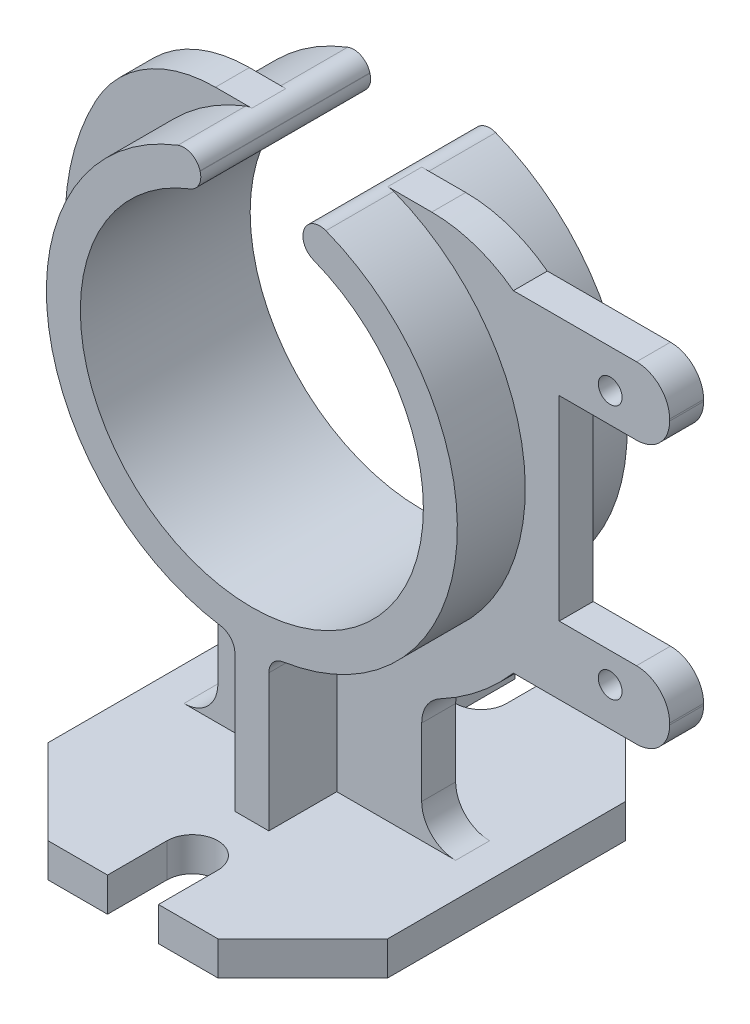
ISO-10303-21;
HEADER;
FILE_DESCRIPTION(('STEP AP214'),'2;1');
FILE_NAME('part.step','',(''),(''),'','','');
FILE_SCHEMA(('AUTOMOTIVE_DESIGN { 1 0 10303 214 1 1 1 1 }'));
ENDSEC;
DATA;
#1=APPLICATION_CONTEXT('core data for automotive mechanical design processes');
#2=APPLICATION_PROTOCOL_DEFINITION('international standard','automotive_design',2000,#1);
#3=PRODUCT_CONTEXT('',#1,'mechanical');
#4=PRODUCT('Part','Part','',(#3));
#5=PRODUCT_RELATED_PRODUCT_CATEGORY('part','',(#4));
#6=PRODUCT_DEFINITION_FORMATION('','',#4);
#7=PRODUCT_DEFINITION_CONTEXT('part definition',#1,'design');
#8=PRODUCT_DEFINITION('design','',#6,#7);
#9=PRODUCT_DEFINITION_SHAPE('','',#8);
#10=(LENGTH_UNIT() NAMED_UNIT(*) SI_UNIT(.MILLI.,.METRE.));
#11=(NAMED_UNIT(*) PLANE_ANGLE_UNIT() SI_UNIT($,.RADIAN.));
#12=(NAMED_UNIT(*) SI_UNIT($,.STERADIAN.) SOLID_ANGLE_UNIT());
#13=UNCERTAINTY_MEASURE_WITH_UNIT(LENGTH_MEASURE(1.E-05),#10,'distance_accuracy_value','');
#14=(GEOMETRIC_REPRESENTATION_CONTEXT(3) GLOBAL_UNCERTAINTY_ASSIGNED_CONTEXT((#13)) GLOBAL_UNIT_ASSIGNED_CONTEXT((#10,
#11,#12)) REPRESENTATION_CONTEXT('',''));
#15=CARTESIAN_POINT('',(0.,0.,0.));
#16=DIRECTION('',(0.,0.,1.));
#17=DIRECTION('',(1.,0.,0.));
#18=AXIS2_PLACEMENT_3D('',#15,#16,#17);
#19=CARTESIAN_POINT('',(-0.999999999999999,10.0621485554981,5.));
#20=DIRECTION('',(1.,0.,0.));
#21=DIRECTION('',(0.,1.,0.));
#22=AXIS2_PLACEMENT_3D('',#19,#20,#21);
#23=PLANE('',#22);
#24=DIRECTION('',(0.,-1.,0.));
#25=VECTOR('',#24,1.);
#26=CARTESIAN_POINT('',(-0.999999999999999,10.0621485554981,-1.));
#27=LINE('',#26,#25);
#28=CARTESIAN_POINT('',(-0.999999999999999,10.0621485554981,-1.));
#29=VERTEX_POINT('',#28);
#30=CARTESIAN_POINT('',(-0.999999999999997,2.,-1.));
#31=VERTEX_POINT('',#30);
#32=EDGE_CURVE('E547',#29,#31,#27,.T.);
#33=ORIENTED_EDGE('',*,*,#32,.F.);
#34=DIRECTION('',(0.,0.,-1.));
#35=VECTOR('',#34,1.);
#36=CARTESIAN_POINT('',(-0.999999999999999,10.0621485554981,5.));
#37=LINE('',#36,#35);
#38=CARTESIAN_POINT('',(-0.999999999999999,10.0621485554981,-5.));
#39=VERTEX_POINT('',#38);
#40=EDGE_CURVE('E765',#29,#39,#37,.T.);
#41=ORIENTED_EDGE('',*,*,#40,.T.);
#42=DIRECTION('',(0.,-1.,0.));
#43=VECTOR('',#42,1.);
#44=CARTESIAN_POINT('',(-0.999999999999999,10.0621485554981,-5.));
#45=LINE('',#44,#43);
#46=CARTESIAN_POINT('',(-0.999999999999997,2.,-5.));
#47=VERTEX_POINT('',#46);
#48=EDGE_CURVE('E703',#39,#47,#45,.T.);
#49=ORIENTED_EDGE('',*,*,#48,.T.);
#50=DIRECTION('',(0.,0.,-1.));
#51=VECTOR('',#50,1.);
#52=CARTESIAN_POINT('',(-0.999999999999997,2.,5.));
#53=LINE('',#52,#51);
#54=EDGE_CURVE('E678',#31,#47,#53,.T.);
#55=ORIENTED_EDGE('',*,*,#54,.F.);
#56=EDGE_LOOP('',(#33,#41,#49,#55));
#57=FACE_BOUND('',#56,.T.);
#58=ADVANCED_FACE('F33',(#57),#23,.F.);
#59=CARTESIAN_POINT('',(1.,0.,5.));
#60=DIRECTION('',(-1.,0.,0.));
#61=DIRECTION('',(0.,-1.,0.));
#62=AXIS2_PLACEMENT_3D('',#59,#60,#61);
#63=PLANE('',#62);
#64=DIRECTION('',(0.,1.,0.));
#65=VECTOR('',#64,1.);
#66=CARTESIAN_POINT('',(1.,0.,-1.));
#67=LINE('',#66,#65);
#68=CARTESIAN_POINT('',(1.,2.,-1.));
#69=VERTEX_POINT('',#68);
#70=CARTESIAN_POINT('',(1.,10.0621485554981,-1.));
#71=VERTEX_POINT('',#70);
#72=EDGE_CURVE('E559',#69,#71,#67,.T.);
#73=ORIENTED_EDGE('',*,*,#72,.F.);
#74=DIRECTION('',(0.,0.,1.));
#75=VECTOR('',#74,1.);
#76=CARTESIAN_POINT('',(1.,2.,5.));
#77=LINE('',#76,#75);
#78=CARTESIAN_POINT('',(1.,2.,-5.));
#79=VERTEX_POINT('',#78);
#80=EDGE_CURVE('E675',#79,#69,#77,.T.);
#81=ORIENTED_EDGE('',*,*,#80,.F.);
#82=DIRECTION('',(0.,1.,0.));
#83=VECTOR('',#82,1.);
#84=CARTESIAN_POINT('',(1.,0.,-5.));
#85=LINE('',#84,#83);
#86=CARTESIAN_POINT('',(1.,10.0621485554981,-5.));
#87=VERTEX_POINT('',#86);
#88=EDGE_CURVE('E706',#79,#87,#85,.T.);
#89=ORIENTED_EDGE('',*,*,#88,.T.);
#90=DIRECTION('',(0.,0.,-1.));
#91=VECTOR('',#90,1.);
#92=CARTESIAN_POINT('',(1.,10.0621485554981,5.));
#93=LINE('',#92,#91);
#94=EDGE_CURVE('E761',#71,#87,#93,.T.);
#95=ORIENTED_EDGE('',*,*,#94,.F.);
#96=EDGE_LOOP('',(#73,#81,#89,#95));
#97=FACE_BOUND('',#96,.T.);
#98=ADVANCED_FACE('F931',(#97),#63,.F.);
#99=CARTESIAN_POINT('',(0.,23.,5.));
#100=DIRECTION('',(0.,0.,-1.));
#101=DIRECTION('',(-1.,0.,0.));
#102=AXIS2_PLACEMENT_3D('',#99,#100,#101);
#103=CYLINDRICAL_SURFACE('',#102,12.1);
#104=CARTESIAN_POINT('',(0.,23.,-1.));
#105=DIRECTION('',(0.,0.,1.));
#106=DIRECTION('',(1.,0.,0.));
#107=AXIS2_PLACEMENT_3D('',#104,#105,#106);
#108=CIRCLE('',#107,12.1);
#109=CARTESIAN_POINT('',(-4.35839365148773,34.2877989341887,-1.));
#110=VERTEX_POINT('',#109);
#111=CARTESIAN_POINT('',(-1.83949579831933,11.040641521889,-1.));
#112=VERTEX_POINT('',#111);
#113=EDGE_CURVE('E553',#110,#112,#108,.T.);
#114=ORIENTED_EDGE('',*,*,#113,.F.);
#115=DIRECTION('',(0.,0.,-1.));
#116=VECTOR('',#115,1.);
#117=CARTESIAN_POINT('',(-4.35839365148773,34.2877989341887,5.));
#118=LINE('',#117,#116);
#119=CARTESIAN_POINT('',(-4.35839365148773,34.2877989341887,-5.));
#120=VERTEX_POINT('',#119);
#121=EDGE_CURVE('E773',#110,#120,#118,.T.);
#122=ORIENTED_EDGE('',*,*,#121,.T.);
#123=CARTESIAN_POINT('',(0.,23.,-5.));
#124=DIRECTION('',(0.,0.,1.));
#125=DIRECTION('',(1.,0.,0.));
#126=AXIS2_PLACEMENT_3D('',#123,#124,#125);
#127=CIRCLE('',#126,12.1);
#128=CARTESIAN_POINT('',(-1.83949579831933,11.040641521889,-5.));
#129=VERTEX_POINT('',#128);
#130=EDGE_CURVE('E697',#120,#129,#127,.T.);
#131=ORIENTED_EDGE('',*,*,#130,.T.);
#132=DIRECTION('',(0.,0.,-1.));
#133=VECTOR('',#132,1.);
#134=CARTESIAN_POINT('',(-1.83949579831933,11.040641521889,5.));
#135=LINE('',#134,#133);
#136=EDGE_CURVE('E769',#112,#129,#135,.T.);
#137=ORIENTED_EDGE('',*,*,#136,.F.);
#138=EDGE_LOOP('',(#114,#122,#131,#137));
#139=FACE_BOUND('',#138,.T.);
#140=ADVANCED_FACE('F992',(#139),#103,.T.);
#141=CARTESIAN_POINT('',(-1.99,10.0621485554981,5.));
#142=DIRECTION('',(0.,0.,-1.));
#143=DIRECTION('',(-1.,0.,0.));
#144=AXIS2_PLACEMENT_3D('',#141,#142,#143);
#145=CYLINDRICAL_SURFACE('',#144,0.989999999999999);
#146=CARTESIAN_POINT('',(-1.99,10.0621485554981,-1.));
#147=DIRECTION('',(0.,0.,1.));
#148=DIRECTION('',(1.,0.,0.));
#149=AXIS2_PLACEMENT_3D('',#146,#147,#148);
#150=CIRCLE('',#149,0.989999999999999);
#151=EDGE_CURVE('E550',#112,#29,#150,.F.);
#152=ORIENTED_EDGE('',*,*,#151,.F.);
#153=ORIENTED_EDGE('',*,*,#136,.T.);
#154=CARTESIAN_POINT('',(-1.99,10.0621485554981,-5.));
#155=DIRECTION('',(0.,0.,-1.));
#156=DIRECTION('',(-1.,0.,0.));
#157=AXIS2_PLACEMENT_3D('',#154,#155,#156);
#158=CIRCLE('',#157,0.989999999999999);
#159=EDGE_CURVE('E700',#129,#39,#158,.T.);
#160=ORIENTED_EDGE('',*,*,#159,.T.);
#161=ORIENTED_EDGE('',*,*,#40,.F.);
#162=EDGE_LOOP('',(#152,#153,#160,#161));
#163=FACE_BOUND('',#162,.T.);
#164=ADVANCED_FACE('F1183',(#163),#145,.F.);
#165=CARTESIAN_POINT('',(1.99,10.0621485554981,5.));
#166=DIRECTION('',(0.,0.,-1.));
#167=DIRECTION('',(-1.,0.,0.));
#168=AXIS2_PLACEMENT_3D('',#165,#166,#167);
#169=CYLINDRICAL_SURFACE('',#168,0.990000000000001);
#170=CARTESIAN_POINT('',(1.99,10.0621485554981,-1.));
#171=DIRECTION('',(0.,0.,1.));
#172=DIRECTION('',(1.,0.,0.));
#173=AXIS2_PLACEMENT_3D('',#170,#171,#172);
#174=CIRCLE('',#173,0.990000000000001);
#175=CARTESIAN_POINT('',(1.83949579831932,11.040641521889,-1.));
#176=VERTEX_POINT('',#175);
#177=EDGE_CURVE('E562',#71,#176,#174,.F.);
#178=ORIENTED_EDGE('',*,*,#177,.F.);
#179=ORIENTED_EDGE('',*,*,#94,.T.);
#180=CARTESIAN_POINT('',(1.99,10.0621485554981,-5.));
#181=DIRECTION('',(0.,0.,-1.));
#182=DIRECTION('',(1.,0.,0.));
#183=AXIS2_PLACEMENT_3D('',#180,#181,#182);
#184=CIRCLE('',#183,0.990000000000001);
#185=CARTESIAN_POINT('',(1.83949579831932,11.040641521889,-5.));
#186=VERTEX_POINT('',#185);
#187=EDGE_CURVE('E709',#87,#186,#184,.T.);
#188=ORIENTED_EDGE('',*,*,#187,.T.);
#189=DIRECTION('',(0.,0.,-1.));
#190=VECTOR('',#189,1.);
#191=CARTESIAN_POINT('',(1.83949579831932,11.040641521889,5.));
#192=LINE('',#191,#190);
#193=EDGE_CURVE('E757',#176,#186,#192,.T.);
#194=ORIENTED_EDGE('',*,*,#193,.F.);
#195=EDGE_LOOP('',(#178,#179,#188,#194));
#196=FACE_BOUND('',#195,.T.);
#197=ADVANCED_FACE('F935',(#196),#169,.F.);
#198=CARTESIAN_POINT('',(0.,23.,5.));
#199=DIRECTION('',(0.,0.,-1.));
#200=DIRECTION('',(-1.,0.,0.));
#201=AXIS2_PLACEMENT_3D('',#198,#199,#200);
#202=CYLINDRICAL_SURFACE('',#201,12.1);
#203=CARTESIAN_POINT('',(0.,23.,-1.));
#204=DIRECTION('',(0.,0.,1.));
#205=DIRECTION('',(1.,0.,0.));
#206=AXIS2_PLACEMENT_3D('',#203,#204,#205);
#207=CIRCLE('',#206,12.1);
#208=CARTESIAN_POINT('',(4.35839365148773,34.2877989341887,-1.));
#209=VERTEX_POINT('',#208);
#210=EDGE_CURVE('E565',#176,#209,#207,.T.);
#211=ORIENTED_EDGE('',*,*,#210,.F.);
#212=ORIENTED_EDGE('',*,*,#193,.T.);
#213=CARTESIAN_POINT('',(0.,23.,-5.));
#214=DIRECTION('',(0.,0.,1.));
#215=DIRECTION('',(1.,0.,0.));
#216=AXIS2_PLACEMENT_3D('',#213,#214,#215);
#217=CIRCLE('',#216,12.1);
#218=CARTESIAN_POINT('',(4.35839365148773,34.2877989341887,-5.));
#219=VERTEX_POINT('',#218);
#220=EDGE_CURVE('E712',#186,#219,#217,.T.);
#221=ORIENTED_EDGE('',*,*,#220,.T.);
#222=DIRECTION('',(0.,0.,-1.));
#223=VECTOR('',#222,1.);
#224=CARTESIAN_POINT('',(4.35839365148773,34.2877989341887,5.));
#225=LINE('',#224,#223);
#226=EDGE_CURVE('E753',#209,#219,#225,.T.);
#227=ORIENTED_EDGE('',*,*,#226,.F.);
#228=EDGE_LOOP('',(#211,#212,#221,#227));
#229=FACE_BOUND('',#228,.T.);
#230=ADVANCED_FACE('F940',(#229),#202,.T.);
#231=CARTESIAN_POINT('',(-0.999999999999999,10.0621485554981,5.));
#232=VERTEX_POINT('',#231);
#233=CARTESIAN_POINT('',(-0.999999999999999,10.0621485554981,1.));
#234=VERTEX_POINT('',#233);
#235=EDGE_CURVE('E766',#232,#234,#37,.T.);
#236=ORIENTED_EDGE('',*,*,#235,.T.);
#237=DIRECTION('',(0.,-1.,0.));
#238=VECTOR('',#237,1.);
#239=CARTESIAN_POINT('',(-0.999999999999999,10.0621485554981,1.));
#240=LINE('',#239,#238);
#241=CARTESIAN_POINT('',(-0.999999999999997,2.,1.));
#242=VERTEX_POINT('',#241);
#243=EDGE_CURVE('E571',#234,#242,#240,.T.);
#244=ORIENTED_EDGE('',*,*,#243,.T.);
#245=CARTESIAN_POINT('',(-0.999999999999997,2.,5.));
#246=VERTEX_POINT('',#245);
#247=EDGE_CURVE('E679',#246,#242,#53,.T.);
#248=ORIENTED_EDGE('',*,*,#247,.F.);
#249=DIRECTION('',(0.,-1.,0.));
#250=VECTOR('',#249,1.);
#251=CARTESIAN_POINT('',(-0.999999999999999,10.0621485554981,5.));
#252=LINE('',#251,#250);
#253=EDGE_CURVE('E734',#232,#246,#252,.T.);
#254=ORIENTED_EDGE('',*,*,#253,.F.);
#255=EDGE_LOOP('',(#236,#244,#248,#254));
#256=FACE_BOUND('',#255,.T.);
#257=ADVANCED_FACE('F987',(#256),#23,.F.);
#258=CARTESIAN_POINT('',(1.,2.,1.));
#259=VERTEX_POINT('',#258);
#260=CARTESIAN_POINT('',(1.,2.,5.));
#261=VERTEX_POINT('',#260);
#262=EDGE_CURVE('E659',#259,#261,#77,.T.);
#263=ORIENTED_EDGE('',*,*,#262,.F.);
#264=DIRECTION('',(0.,1.,0.));
#265=VECTOR('',#264,1.);
#266=CARTESIAN_POINT('',(1.,0.,1.));
#267=LINE('',#266,#265);
#268=CARTESIAN_POINT('',(1.,10.0621485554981,1.));
#269=VERTEX_POINT('',#268);
#270=EDGE_CURVE('E579',#259,#269,#267,.T.);
#271=ORIENTED_EDGE('',*,*,#270,.T.);
#272=CARTESIAN_POINT('',(1.,10.0621485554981,5.));
#273=VERTEX_POINT('',#272);
#274=EDGE_CURVE('E762',#273,#269,#93,.T.);
#275=ORIENTED_EDGE('',*,*,#274,.F.);
#276=DIRECTION('',(0.,1.,0.));
#277=VECTOR('',#276,1.);
#278=CARTESIAN_POINT('',(1.,0.,5.));
#279=LINE('',#278,#277);
#280=EDGE_CURVE('E737',#261,#273,#279,.T.);
#281=ORIENTED_EDGE('',*,*,#280,.F.);
#282=EDGE_LOOP('',(#263,#271,#275,#281));
#283=FACE_BOUND('',#282,.T.);
#284=ADVANCED_FACE('F994',(#283),#63,.F.);
#285=CARTESIAN_POINT('',(3.99626300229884,33.3449495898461,5.));
#286=DIRECTION('',(0.,0.,1.));
#287=DIRECTION('',(1.,0.,0.));
#288=AXIS2_PLACEMENT_3D('',#285,#286,#287);
#289=PLANE('',#288);
#290=ORIENTED_EDGE('',*,*,#253,.T.);
#291=DIRECTION('',(1.,0.,0.));
#292=VECTOR('',#291,1.);
#293=CARTESIAN_POINT('',(3.99626300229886,2.,5.));
#294=LINE('',#293,#292);
#295=EDGE_CURVE('E682',#246,#261,#294,.T.);
#296=ORIENTED_EDGE('',*,*,#295,.T.);
#297=ORIENTED_EDGE('',*,*,#280,.T.);
#298=CARTESIAN_POINT('',(1.99,10.0621485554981,5.));
#299=DIRECTION('',(0.,0.,-1.));
#300=DIRECTION('',(1.,0.,0.));
#301=AXIS2_PLACEMENT_3D('',#298,#299,#300);
#302=CIRCLE('',#301,0.990000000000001);
#303=CARTESIAN_POINT('',(1.83949579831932,11.040641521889,5.));
#304=VERTEX_POINT('',#303);
#305=EDGE_CURVE('E739',#273,#304,#302,.T.);
#306=ORIENTED_EDGE('',*,*,#305,.T.);
#307=CARTESIAN_POINT('',(0.,23.,5.));
#308=DIRECTION('',(0.,0.,1.));
#309=DIRECTION('',(1.,0.,0.));
#310=AXIS2_PLACEMENT_3D('',#307,#308,#309);
#311=CIRCLE('',#310,12.1);
#312=CARTESIAN_POINT('',(4.35839365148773,34.2877989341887,5.));
#313=VERTEX_POINT('',#312);
#314=EDGE_CURVE('E741',#304,#313,#311,.T.);
#315=ORIENTED_EDGE('',*,*,#314,.T.);
#316=CARTESIAN_POINT('',(4.0017978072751,33.3642517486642,5.));
#317=DIRECTION('',(0.,0.,1.));
#318=DIRECTION('',(-1.,0.,0.));
#319=AXIS2_PLACEMENT_3D('',#316,#317,#318);
#320=CIRCLE('',#319,0.990000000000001);
#321=CARTESIAN_POINT('',(3.05014872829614,33.6371327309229,5.));
#322=VERTEX_POINT('',#321);
#323=EDGE_CURVE('E743',#313,#322,#320,.T.);
#324=ORIENTED_EDGE('',*,*,#323,.T.);
#325=DIRECTION('',(-0.275637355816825,-0.961261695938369,0.));
#326=VECTOR('',#325,1.);
#327=CARTESIAN_POINT('',(3.04461392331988,33.6178305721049,5.));
#328=LINE('',#327,#326);
#329=CARTESIAN_POINT('',(3.04461392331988,33.6178305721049,5.));
#330=VERTEX_POINT('',#329);
#331=EDGE_CURVE('E745',#322,#330,#328,.T.);
#332=ORIENTED_EDGE('',*,*,#331,.T.);
#333=CARTESIAN_POINT('',(3.99626300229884,33.3449495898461,5.));
#334=DIRECTION('',(0.,0.,1.));
#335=DIRECTION('',(1.,0.,0.));
#336=AXIS2_PLACEMENT_3D('',#333,#334,#335);
#337=CIRCLE('',#336,0.989999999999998);
#338=CARTESIAN_POINT('',(3.63951815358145,32.4214599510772,5.));
#339=VERTEX_POINT('',#338);
#340=EDGE_CURVE('E719',#330,#339,#337,.T.);
#341=ORIENTED_EDGE('',*,*,#340,.T.);
#342=CARTESIAN_POINT('',(0.,23.,5.));
#343=DIRECTION('',(0.,0.,-1.));
#344=DIRECTION('',(1.,0.,0.));
#345=AXIS2_PLACEMENT_3D('',#342,#343,#344);
#346=CIRCLE('',#345,10.1);
#347=CARTESIAN_POINT('',(-3.63951815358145,32.4214599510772,5.));
#348=VERTEX_POINT('',#347);
#349=EDGE_CURVE('E722',#339,#348,#346,.T.);
#350=ORIENTED_EDGE('',*,*,#349,.T.);
#351=CARTESIAN_POINT('',(-3.99626300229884,33.3449495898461,5.));
#352=DIRECTION('',(0.,0.,1.));
#353=DIRECTION('',(1.,0.,0.));
#354=AXIS2_PLACEMENT_3D('',#351,#352,#353);
#355=CIRCLE('',#354,0.989999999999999);
#356=CARTESIAN_POINT('',(-3.04461392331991,33.617830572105,5.));
#357=VERTEX_POINT('',#356);
#358=EDGE_CURVE('E724',#348,#357,#355,.T.);
#359=ORIENTED_EDGE('',*,*,#358,.T.);
#360=DIRECTION('',(-0.275637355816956,0.961261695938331,0.));
#361=VECTOR('',#360,1.);
#362=CARTESIAN_POINT('',(-3.04461392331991,33.617830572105,5.));
#363=LINE('',#362,#361);
#364=CARTESIAN_POINT('',(-3.05014872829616,33.637132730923,5.));
#365=VERTEX_POINT('',#364);
#366=EDGE_CURVE('E726',#357,#365,#363,.T.);
#367=ORIENTED_EDGE('',*,*,#366,.T.);
#368=CARTESIAN_POINT('',(-4.0017978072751,33.3642517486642,5.));
#369=DIRECTION('',(0.,0.,1.));
#370=DIRECTION('',(-1.,0.,0.));
#371=AXIS2_PLACEMENT_3D('',#368,#369,#370);
#372=CIRCLE('',#371,0.99);
#373=CARTESIAN_POINT('',(-4.35839365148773,34.2877989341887,5.));
#374=VERTEX_POINT('',#373);
#375=EDGE_CURVE('E728',#365,#374,#372,.T.);
#376=ORIENTED_EDGE('',*,*,#375,.T.);
#377=CARTESIAN_POINT('',(0.,23.,5.));
#378=DIRECTION('',(0.,0.,1.));
#379=DIRECTION('',(1.,0.,0.));
#380=AXIS2_PLACEMENT_3D('',#377,#378,#379);
#381=CIRCLE('',#380,12.1);
#382=CARTESIAN_POINT('',(-1.83949579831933,11.040641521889,5.));
#383=VERTEX_POINT('',#382);
#384=EDGE_CURVE('E730',#374,#383,#381,.T.);
#385=ORIENTED_EDGE('',*,*,#384,.T.);
#386=CARTESIAN_POINT('',(-1.99,10.0621485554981,5.));
#387=DIRECTION('',(0.,0.,-1.));
#388=DIRECTION('',(-1.,0.,0.));
#389=AXIS2_PLACEMENT_3D('',#386,#387,#388);
#390=CIRCLE('',#389,0.989999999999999);
#391=EDGE_CURVE('E732',#383,#232,#390,.T.);
#392=ORIENTED_EDGE('',*,*,#391,.T.);
#393=EDGE_LOOP('',(#290,#296,#297,#306,#315,#324,#332,#341,#350,#359,#367,#376,#385,#392));
#394=FACE_BOUND('',#393,.T.);
#395=ADVANCED_FACE('F1002',(#394),#289,.T.);
#396=CARTESIAN_POINT('',(3.99626300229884,33.3449495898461,-5.));
#397=DIRECTION('',(0.,0.,1.));
#398=DIRECTION('',(1.,0.,0.));
#399=AXIS2_PLACEMENT_3D('',#396,#397,#398);
#400=PLANE('',#399);
#401=DIRECTION('',(1.,0.,0.));
#402=VECTOR('',#401,1.);
#403=CARTESIAN_POINT('',(3.99626300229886,2.,-5.));
#404=LINE('',#403,#402);
#405=EDGE_CURVE('E789',#47,#79,#404,.T.);
#406=ORIENTED_EDGE('',*,*,#405,.F.);
#407=ORIENTED_EDGE('',*,*,#48,.F.);
#408=ORIENTED_EDGE('',*,*,#159,.F.);
#409=ORIENTED_EDGE('',*,*,#130,.F.);
#410=CARTESIAN_POINT('',(-4.0017978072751,33.3642517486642,-5.));
#411=DIRECTION('',(0.,0.,1.));
#412=DIRECTION('',(-1.,0.,0.));
#413=AXIS2_PLACEMENT_3D('',#410,#411,#412);
#414=CIRCLE('',#413,0.99);
#415=CARTESIAN_POINT('',(-3.05014872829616,33.637132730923,-5.));
#416=VERTEX_POINT('',#415);
#417=EDGE_CURVE('E694',#416,#120,#414,.T.);
#418=ORIENTED_EDGE('',*,*,#417,.F.);
#419=DIRECTION('',(-0.275637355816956,0.961261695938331,0.));
#420=VECTOR('',#419,1.);
#421=CARTESIAN_POINT('',(-3.04461392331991,33.617830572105,-5.));
#422=LINE('',#421,#420);
#423=CARTESIAN_POINT('',(-3.04461392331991,33.617830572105,-5.));
#424=VERTEX_POINT('',#423);
#425=EDGE_CURVE('E692',#424,#416,#422,.T.);
#426=ORIENTED_EDGE('',*,*,#425,.F.);
#427=CARTESIAN_POINT('',(-3.99626300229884,33.3449495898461,-5.));
#428=DIRECTION('',(0.,0.,1.));
#429=DIRECTION('',(1.,0.,0.));
#430=AXIS2_PLACEMENT_3D('',#427,#428,#429);
#431=CIRCLE('',#430,0.989999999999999);
#432=CARTESIAN_POINT('',(-3.63951815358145,32.4214599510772,-5.));
#433=VERTEX_POINT('',#432);
#434=EDGE_CURVE('E690',#433,#424,#431,.T.);
#435=ORIENTED_EDGE('',*,*,#434,.F.);
#436=CARTESIAN_POINT('',(0.,23.,-5.));
#437=DIRECTION('',(0.,0.,-1.));
#438=DIRECTION('',(1.,0.,0.));
#439=AXIS2_PLACEMENT_3D('',#436,#437,#438);
#440=CIRCLE('',#439,10.1);
#441=CARTESIAN_POINT('',(3.63951815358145,32.4214599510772,-5.));
#442=VERTEX_POINT('',#441);
#443=EDGE_CURVE('E688',#442,#433,#440,.T.);
#444=ORIENTED_EDGE('',*,*,#443,.F.);
#445=CARTESIAN_POINT('',(3.99626300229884,33.3449495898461,-5.));
#446=DIRECTION('',(0.,0.,1.));
#447=DIRECTION('',(1.,0.,0.));
#448=AXIS2_PLACEMENT_3D('',#445,#446,#447);
#449=CIRCLE('',#448,0.989999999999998);
#450=CARTESIAN_POINT('',(3.04461392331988,33.6178305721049,-5.));
#451=VERTEX_POINT('',#450);
#452=EDGE_CURVE('E685',#451,#442,#449,.T.);
#453=ORIENTED_EDGE('',*,*,#452,.F.);
#454=DIRECTION('',(-0.275637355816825,-0.961261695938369,0.));
#455=VECTOR('',#454,1.);
#456=CARTESIAN_POINT('',(3.04461392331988,33.6178305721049,-5.));
#457=LINE('',#456,#455);
#458=CARTESIAN_POINT('',(3.05014872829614,33.6371327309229,-5.));
#459=VERTEX_POINT('',#458);
#460=EDGE_CURVE('E717',#459,#451,#457,.T.);
#461=ORIENTED_EDGE('',*,*,#460,.F.);
#462=CARTESIAN_POINT('',(4.0017978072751,33.3642517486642,-5.));
#463=DIRECTION('',(0.,0.,1.));
#464=DIRECTION('',(-1.,0.,0.));
#465=AXIS2_PLACEMENT_3D('',#462,#463,#464);
#466=CIRCLE('',#465,0.990000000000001);
#467=EDGE_CURVE('E715',#219,#459,#466,.T.);
#468=ORIENTED_EDGE('',*,*,#467,.F.);
#469=ORIENTED_EDGE('',*,*,#220,.F.);
#470=ORIENTED_EDGE('',*,*,#187,.F.);
#471=ORIENTED_EDGE('',*,*,#88,.F.);
#472=EDGE_LOOP('',(#406,#407,#408,#409,#418,#426,#435,#444,#453,#461,#468,#469,#470,#471));
#473=FACE_BOUND('',#472,.T.);
#474=ADVANCED_FACE('F1162',(#473),#400,.F.);
#475=CARTESIAN_POINT('',(3.99626300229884,33.3449495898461,5.));
#476=DIRECTION('',(0.,0.,-1.));
#477=DIRECTION('',(-1.,0.,0.));
#478=AXIS2_PLACEMENT_3D('',#475,#476,#477);
#479=CYLINDRICAL_SURFACE('',#478,0.989999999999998);
#480=ORIENTED_EDGE('',*,*,#452,.T.);
#481=DIRECTION('',(0.,0.,-1.));
#482=VECTOR('',#481,1.);
#483=CARTESIAN_POINT('',(3.63951815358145,32.4214599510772,5.));
#484=LINE('',#483,#482);
#485=EDGE_CURVE('E786',#339,#442,#484,.T.);
#486=ORIENTED_EDGE('',*,*,#485,.F.);
#487=ORIENTED_EDGE('',*,*,#340,.F.);
#488=DIRECTION('',(0.,0.,-1.));
#489=VECTOR('',#488,1.);
#490=CARTESIAN_POINT('',(3.04461392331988,33.6178305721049,5.));
#491=LINE('',#490,#489);
#492=EDGE_CURVE('E747',#330,#451,#491,.T.);
#493=ORIENTED_EDGE('',*,*,#492,.T.);
#494=EDGE_LOOP('',(#480,#486,#487,#493));
#495=FACE_BOUND('',#494,.T.);
#496=ADVANCED_FACE('F35',(#495),#479,.T.);
#497=CARTESIAN_POINT('',(0.,23.,5.));
#498=DIRECTION('',(0.,0.,-1.));
#499=DIRECTION('',(-1.,0.,0.));
#500=AXIS2_PLACEMENT_3D('',#497,#498,#499);
#501=CYLINDRICAL_SURFACE('',#500,10.1);
#502=ORIENTED_EDGE('',*,*,#443,.T.);
#503=DIRECTION('',(0.,0.,-1.));
#504=VECTOR('',#503,1.);
#505=CARTESIAN_POINT('',(-3.63951815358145,32.4214599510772,5.));
#506=LINE('',#505,#504);
#507=EDGE_CURVE('E783',#348,#433,#506,.T.);
#508=ORIENTED_EDGE('',*,*,#507,.F.);
#509=ORIENTED_EDGE('',*,*,#349,.F.);
#510=ORIENTED_EDGE('',*,*,#485,.T.);
#511=EDGE_LOOP('',(#502,#508,#509,#510));
#512=FACE_BOUND('',#511,.T.);
#513=ADVANCED_FACE('F1207',(#512),#501,.F.);
#514=CARTESIAN_POINT('',(-3.99626300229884,33.3449495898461,5.));
#515=DIRECTION('',(0.,0.,-1.));
#516=DIRECTION('',(-1.,0.,0.));
#517=AXIS2_PLACEMENT_3D('',#514,#515,#516);
#518=CYLINDRICAL_SURFACE('',#517,0.989999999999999);
#519=ORIENTED_EDGE('',*,*,#434,.T.);
#520=DIRECTION('',(0.,0.,-1.));
#521=VECTOR('',#520,1.);
#522=CARTESIAN_POINT('',(-3.04461392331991,33.617830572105,5.));
#523=LINE('',#522,#521);
#524=EDGE_CURVE('E780',#357,#424,#523,.T.);
#525=ORIENTED_EDGE('',*,*,#524,.F.);
#526=ORIENTED_EDGE('',*,*,#358,.F.);
#527=ORIENTED_EDGE('',*,*,#507,.T.);
#528=EDGE_LOOP('',(#519,#525,#526,#527));
#529=FACE_BOUND('',#528,.T.);
#530=ADVANCED_FACE('F1204',(#529),#518,.T.);
#531=CARTESIAN_POINT('',(-3.04461392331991,33.617830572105,5.));
#532=DIRECTION('',(-0.961261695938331,-0.275637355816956,0.));
#533=DIRECTION('',(0.275637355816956,-0.961261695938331,0.));
#534=AXIS2_PLACEMENT_3D('',#531,#532,#533);
#535=PLANE('',#534);
#536=ORIENTED_EDGE('',*,*,#425,.T.);
#537=DIRECTION('',(0.,0.,-1.));
#538=VECTOR('',#537,1.);
#539=CARTESIAN_POINT('',(-3.05014872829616,33.637132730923,5.));
#540=LINE('',#539,#538);
#541=EDGE_CURVE('E777',#365,#416,#540,.T.);
#542=ORIENTED_EDGE('',*,*,#541,.F.);
#543=ORIENTED_EDGE('',*,*,#366,.F.);
#544=ORIENTED_EDGE('',*,*,#524,.T.);
#545=EDGE_LOOP('',(#536,#542,#543,#544));
#546=FACE_BOUND('',#545,.T.);
#547=ADVANCED_FACE('F1200',(#546),#535,.F.);
#548=CARTESIAN_POINT('',(-4.0017978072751,33.3642517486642,5.));
#549=DIRECTION('',(0.,0.,-1.));
#550=DIRECTION('',(-1.,0.,0.));
#551=AXIS2_PLACEMENT_3D('',#548,#549,#550);
#552=CYLINDRICAL_SURFACE('',#551,0.99);
#553=DIRECTION('',(0.,0.,-1.));
#554=VECTOR('',#553,1.);
#555=CARTESIAN_POINT('',(-4.0017978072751,34.3542517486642,1.));
#556=LINE('',#555,#554);
#557=CARTESIAN_POINT('',(-4.0017978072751,34.3542517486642,1.));
#558=VERTEX_POINT('',#557);
#559=CARTESIAN_POINT('',(-4.0017978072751,34.3542517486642,-1.));
#560=VERTEX_POINT('',#559);
#561=EDGE_CURVE('E445',#558,#560,#556,.T.);
#562=ORIENTED_EDGE('',*,*,#561,.F.);
#563=CARTESIAN_POINT('',(-4.0017978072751,33.3642517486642,1.));
#564=DIRECTION('',(0.,0.,1.));
#565=DIRECTION('',(1.,0.,0.));
#566=AXIS2_PLACEMENT_3D('',#563,#564,#565);
#567=CIRCLE('',#566,0.99);
#568=CARTESIAN_POINT('',(-4.35839365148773,34.2877989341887,1.));
#569=VERTEX_POINT('',#568);
#570=EDGE_CURVE('E577',#558,#569,#567,.T.);
#571=ORIENTED_EDGE('',*,*,#570,.T.);
#572=EDGE_CURVE('E774',#374,#569,#118,.T.);
#573=ORIENTED_EDGE('',*,*,#572,.F.);
#574=ORIENTED_EDGE('',*,*,#375,.F.);
#575=ORIENTED_EDGE('',*,*,#541,.T.);
#576=ORIENTED_EDGE('',*,*,#417,.T.);
#577=ORIENTED_EDGE('',*,*,#121,.F.);
#578=CARTESIAN_POINT('',(-4.0017978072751,33.3642517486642,-1.));
#579=DIRECTION('',(0.,0.,1.));
#580=DIRECTION('',(1.,0.,0.));
#581=AXIS2_PLACEMENT_3D('',#578,#579,#580);
#582=CIRCLE('',#581,0.99);
#583=EDGE_CURVE('E556',#560,#110,#582,.T.);
#584=ORIENTED_EDGE('',*,*,#583,.F.);
#585=EDGE_LOOP('',(#562,#571,#573,#574,#575,#576,#577,#584));
#586=FACE_BOUND('',#585,.T.);
#587=ADVANCED_FACE('F1196',(#586),#552,.T.);
#588=ORIENTED_EDGE('',*,*,#572,.T.);
#589=CARTESIAN_POINT('',(0.,23.,1.));
#590=DIRECTION('',(0.,0.,1.));
#591=DIRECTION('',(1.,0.,0.));
#592=AXIS2_PLACEMENT_3D('',#589,#590,#591);
#593=CIRCLE('',#592,12.1);
#594=CARTESIAN_POINT('',(-1.83949579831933,11.040641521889,1.));
#595=VERTEX_POINT('',#594);
#596=EDGE_CURVE('E575',#569,#595,#593,.T.);
#597=ORIENTED_EDGE('',*,*,#596,.T.);
#598=EDGE_CURVE('E770',#383,#595,#135,.T.);
#599=ORIENTED_EDGE('',*,*,#598,.F.);
#600=ORIENTED_EDGE('',*,*,#384,.F.);
#601=EDGE_LOOP('',(#588,#597,#599,#600));
#602=FACE_BOUND('',#601,.T.);
#603=ADVANCED_FACE('F1182',(#602),#103,.T.);
#604=ORIENTED_EDGE('',*,*,#598,.T.);
#605=CARTESIAN_POINT('',(-1.99,10.0621485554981,1.));
#606=DIRECTION('',(0.,0.,1.));
#607=DIRECTION('',(1.,0.,0.));
#608=AXIS2_PLACEMENT_3D('',#605,#606,#607);
#609=CIRCLE('',#608,0.989999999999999);
#610=EDGE_CURVE('E573',#595,#234,#609,.F.);
#611=ORIENTED_EDGE('',*,*,#610,.T.);
#612=ORIENTED_EDGE('',*,*,#235,.F.);
#613=ORIENTED_EDGE('',*,*,#391,.F.);
#614=EDGE_LOOP('',(#604,#611,#612,#613));
#615=FACE_BOUND('',#614,.T.);
#616=ADVANCED_FACE('F1177',(#615),#145,.F.);
#617=ORIENTED_EDGE('',*,*,#274,.T.);
#618=CARTESIAN_POINT('',(1.99,10.0621485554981,1.));
#619=DIRECTION('',(0.,0.,1.));
#620=DIRECTION('',(1.,0.,0.));
#621=AXIS2_PLACEMENT_3D('',#618,#619,#620);
#622=CIRCLE('',#621,0.990000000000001);
#623=CARTESIAN_POINT('',(1.83949579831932,11.040641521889,1.));
#624=VERTEX_POINT('',#623);
#625=EDGE_CURVE('E581',#269,#624,#622,.F.);
#626=ORIENTED_EDGE('',*,*,#625,.T.);
#627=EDGE_CURVE('E758',#304,#624,#192,.T.);
#628=ORIENTED_EDGE('',*,*,#627,.F.);
#629=ORIENTED_EDGE('',*,*,#305,.F.);
#630=EDGE_LOOP('',(#617,#626,#628,#629));
#631=FACE_BOUND('',#630,.T.);
#632=ADVANCED_FACE('F1174',(#631),#169,.F.);
#633=ORIENTED_EDGE('',*,*,#627,.T.);
#634=CARTESIAN_POINT('',(0.,23.,1.));
#635=DIRECTION('',(0.,0.,1.));
#636=DIRECTION('',(1.,0.,0.));
#637=AXIS2_PLACEMENT_3D('',#634,#635,#636);
#638=CIRCLE('',#637,12.1);
#639=CARTESIAN_POINT('',(4.35839365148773,34.2877989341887,1.));
#640=VERTEX_POINT('',#639);
#641=EDGE_CURVE('E583',#624,#640,#638,.T.);
#642=ORIENTED_EDGE('',*,*,#641,.T.);
#643=EDGE_CURVE('E754',#313,#640,#225,.T.);
#644=ORIENTED_EDGE('',*,*,#643,.F.);
#645=ORIENTED_EDGE('',*,*,#314,.F.);
#646=EDGE_LOOP('',(#633,#642,#644,#645));
#647=FACE_BOUND('',#646,.T.);
#648=ADVANCED_FACE('F1005',(#647),#202,.T.);
#649=CARTESIAN_POINT('',(4.0017978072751,33.3642517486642,5.));
#650=DIRECTION('',(0.,0.,-1.));
#651=DIRECTION('',(-1.,0.,0.));
#652=AXIS2_PLACEMENT_3D('',#649,#650,#651);
#653=CYLINDRICAL_SURFACE('',#652,0.990000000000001);
#654=ORIENTED_EDGE('',*,*,#643,.T.);
#655=CARTESIAN_POINT('',(4.0017978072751,33.3642517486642,1.));
#656=DIRECTION('',(0.,0.,1.));
#657=DIRECTION('',(1.,0.,0.));
#658=AXIS2_PLACEMENT_3D('',#655,#656,#657);
#659=CIRCLE('',#658,0.990000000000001);
#660=CARTESIAN_POINT('',(4.00179780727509,34.3542517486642,1.));
#661=VERTEX_POINT('',#660);
#662=EDGE_CURVE('E585',#640,#661,#659,.T.);
#663=ORIENTED_EDGE('',*,*,#662,.T.);
#664=DIRECTION('',(0.,0.,-1.));
#665=VECTOR('',#664,1.);
#666=CARTESIAN_POINT('',(4.0017978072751,34.3542517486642,1.));
#667=LINE('',#666,#665);
#668=CARTESIAN_POINT('',(4.00179780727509,34.3542517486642,-1.));
#669=VERTEX_POINT('',#668);
#670=EDGE_CURVE('E544',#661,#669,#667,.T.);
#671=ORIENTED_EDGE('',*,*,#670,.T.);
#672=CARTESIAN_POINT('',(4.0017978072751,33.3642517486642,-1.));
#673=DIRECTION('',(0.,0.,1.));
#674=DIRECTION('',(1.,0.,0.));
#675=AXIS2_PLACEMENT_3D('',#672,#673,#674);
#676=CIRCLE('',#675,0.990000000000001);
#677=EDGE_CURVE('E568',#209,#669,#676,.T.);
#678=ORIENTED_EDGE('',*,*,#677,.F.);
#679=ORIENTED_EDGE('',*,*,#226,.T.);
#680=ORIENTED_EDGE('',*,*,#467,.T.);
#681=DIRECTION('',(0.,0.,-1.));
#682=VECTOR('',#681,1.);
#683=CARTESIAN_POINT('',(3.05014872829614,33.6371327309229,5.));
#684=LINE('',#683,#682);
#685=EDGE_CURVE('E750',#322,#459,#684,.T.);
#686=ORIENTED_EDGE('',*,*,#685,.F.);
#687=ORIENTED_EDGE('',*,*,#323,.F.);
#688=EDGE_LOOP('',(#654,#663,#671,#678,#679,#680,#686,#687));
#689=FACE_BOUND('',#688,.T.);
#690=ADVANCED_FACE('F943',(#689),#653,.T.);
#691=CARTESIAN_POINT('',(3.04461392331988,33.6178305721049,5.));
#692=DIRECTION('',(0.961261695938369,-0.275637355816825,0.));
#693=DIRECTION('',(0.275637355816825,0.961261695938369,0.));
#694=AXIS2_PLACEMENT_3D('',#691,#692,#693);
#695=PLANE('',#694);
#696=ORIENTED_EDGE('',*,*,#460,.T.);
#697=ORIENTED_EDGE('',*,*,#492,.F.);
#698=ORIENTED_EDGE('',*,*,#331,.F.);
#699=ORIENTED_EDGE('',*,*,#685,.T.);
#700=EDGE_LOOP('',(#696,#697,#698,#699));
#701=FACE_BOUND('',#700,.T.);
#702=ADVANCED_FACE('F1160',(#701),#695,.F.);
#703=CARTESIAN_POINT('',(0.,2.,8.5));
#704=DIRECTION('',(0.,-1.,0.));
#705=DIRECTION('',(1.,0.,0.));
#706=AXIS2_PLACEMENT_3D('',#703,#704,#705);
#707=CYLINDRICAL_SURFACE('',#706,1.5);
#708=CARTESIAN_POINT('',(0.,0.,8.5));
#709=DIRECTION('',(0.,1.,0.));
#710=DIRECTION('',(1.,0.,0.));
#711=AXIS2_PLACEMENT_3D('',#708,#709,#710);
#712=CIRCLE('',#711,1.5);
#713=CARTESIAN_POINT('',(1.5,0.,8.5));
#714=VERTEX_POINT('',#713);
#715=CARTESIAN_POINT('',(-1.5,0.,8.5));
#716=VERTEX_POINT('',#715);
#717=EDGE_CURVE('E588',#714,#716,#712,.T.);
#718=ORIENTED_EDGE('',*,*,#717,.F.);
#719=DIRECTION('',(0.,-1.,0.));
#720=VECTOR('',#719,1.);
#721=CARTESIAN_POINT('',(1.5,2.,8.5));
#722=LINE('',#721,#720);
#723=CARTESIAN_POINT('',(1.5,2.,8.5));
#724=VERTEX_POINT('',#723);
#725=EDGE_CURVE('E657',#724,#714,#722,.T.);
#726=ORIENTED_EDGE('',*,*,#725,.F.);
#727=CARTESIAN_POINT('',(0.,2.,8.5));
#728=DIRECTION('',(0.,1.,0.));
#729=DIRECTION('',(1.,0.,0.));
#730=AXIS2_PLACEMENT_3D('',#727,#728,#729);
#731=CIRCLE('',#730,1.5);
#732=CARTESIAN_POINT('',(-1.5,2.,8.5));
#733=VERTEX_POINT('',#732);
#734=EDGE_CURVE('E622',#724,#733,#731,.T.);
#735=ORIENTED_EDGE('',*,*,#734,.T.);
#736=DIRECTION('',(0.,-1.,0.));
#737=VECTOR('',#736,1.);
#738=CARTESIAN_POINT('',(-1.5,2.,8.5));
#739=LINE('',#738,#737);
#740=EDGE_CURVE('E656',#733,#716,#739,.T.);
#741=ORIENTED_EDGE('',*,*,#740,.T.);
#742=EDGE_LOOP('',(#718,#726,#735,#741));
#743=FACE_BOUND('',#742,.T.);
#744=ADVANCED_FACE('F1120',(#743),#707,.F.);
#745=CARTESIAN_POINT('',(1.5,2.,8.5));
#746=DIRECTION('',(-1.,0.,0.));
#747=DIRECTION('',(0.,-1.,0.));
#748=AXIS2_PLACEMENT_3D('',#745,#746,#747);
#749=PLANE('',#748);
#750=DIRECTION('',(0.,0.,-1.));
#751=VECTOR('',#750,1.);
#752=CARTESIAN_POINT('',(1.5,0.,8.5));
#753=LINE('',#752,#751);
#754=CARTESIAN_POINT('',(1.5,0.,12.));
#755=VERTEX_POINT('',#754);
#756=EDGE_CURVE('E619',#755,#714,#753,.T.);
#757=ORIENTED_EDGE('',*,*,#756,.F.);
#758=DIRECTION('',(0.,-1.,0.));
#759=VECTOR('',#758,1.);
#760=CARTESIAN_POINT('',(1.5,2.,12.));
#761=LINE('',#760,#759);
#762=CARTESIAN_POINT('',(1.5,2.,12.));
#763=VERTEX_POINT('',#762);
#764=EDGE_CURVE('E660',#763,#755,#761,.T.);
#765=ORIENTED_EDGE('',*,*,#764,.F.);
#766=DIRECTION('',(0.,0.,-1.));
#767=VECTOR('',#766,1.);
#768=CARTESIAN_POINT('',(1.5,2.,8.5));
#769=LINE('',#768,#767);
#770=EDGE_CURVE('E653',#763,#724,#769,.T.);
#771=ORIENTED_EDGE('',*,*,#770,.T.);
#772=ORIENTED_EDGE('',*,*,#725,.T.);
#773=EDGE_LOOP('',(#757,#765,#771,#772));
#774=FACE_BOUND('',#773,.T.);
#775=ADVANCED_FACE('F1116',(#774),#749,.T.);
#776=CARTESIAN_POINT('',(1.5,2.,12.));
#777=DIRECTION('',(0.,0.,1.));
#778=DIRECTION('',(1.,0.,0.));
#779=AXIS2_PLACEMENT_3D('',#776,#777,#778);
#780=PLANE('',#779);
#781=DIRECTION('',(-1.,0.,0.));
#782=VECTOR('',#781,1.);
#783=CARTESIAN_POINT('',(1.5,0.,12.));
#784=LINE('',#783,#782);
#785=CARTESIAN_POINT('',(4.99999999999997,0.,12.));
#786=VERTEX_POINT('',#785);
#787=EDGE_CURVE('E617',#786,#755,#784,.T.);
#788=ORIENTED_EDGE('',*,*,#787,.F.);
#789=DIRECTION('',(0.,1.,0.));
#790=VECTOR('',#789,1.);
#791=CARTESIAN_POINT('',(4.99999999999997,2.,12.));
#792=LINE('',#791,#790);
#793=CARTESIAN_POINT('',(4.99999999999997,2.,12.));
#794=VERTEX_POINT('',#793);
#795=EDGE_CURVE('E867',#786,#794,#792,.T.);
#796=ORIENTED_EDGE('',*,*,#795,.T.);
#797=DIRECTION('',(-1.,0.,0.));
#798=VECTOR('',#797,1.);
#799=CARTESIAN_POINT('',(1.5,2.,12.));
#800=LINE('',#799,#798);
#801=EDGE_CURVE('E651',#794,#763,#800,.T.);
#802=ORIENTED_EDGE('',*,*,#801,.T.);
#803=ORIENTED_EDGE('',*,*,#764,.T.);
#804=EDGE_LOOP('',(#788,#796,#802,#803));
#805=FACE_BOUND('',#804,.T.);
#806=ADVANCED_FACE('F1119',(#805),#780,.T.);
#807=CARTESIAN_POINT('',(10.,2.,12.));
#808=DIRECTION('',(1.,0.,0.));
#809=DIRECTION('',(0.,1.,0.));
#810=AXIS2_PLACEMENT_3D('',#807,#808,#809);
#811=PLANE('',#810);
#812=DIRECTION('',(0.,0.,1.));
#813=VECTOR('',#812,1.);
#814=CARTESIAN_POINT('',(10.,2.,12.));
#815=LINE('',#814,#813);
#816=CARTESIAN_POINT('',(10.,2.,-6.99999999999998));
#817=VERTEX_POINT('',#816);
#818=CARTESIAN_POINT('',(10.,2.,6.99999999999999));
#819=VERTEX_POINT('',#818);
#820=EDGE_CURVE('E648',#817,#819,#815,.T.);
#821=ORIENTED_EDGE('',*,*,#820,.T.);
#822=DIRECTION('',(0.,-1.,0.));
#823=VECTOR('',#822,1.);
#824=CARTESIAN_POINT('',(10.,2.,6.99999999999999));
#825=LINE('',#824,#823);
#826=CARTESIAN_POINT('',(10.,0.,6.99999999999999));
#827=VERTEX_POINT('',#826);
#828=EDGE_CURVE('E864',#819,#827,#825,.T.);
#829=ORIENTED_EDGE('',*,*,#828,.T.);
#830=DIRECTION('',(0.,0.,1.));
#831=VECTOR('',#830,1.);
#832=CARTESIAN_POINT('',(10.,0.,12.));
#833=LINE('',#832,#831);
#834=CARTESIAN_POINT('',(10.,0.,-6.99999999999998));
#835=VERTEX_POINT('',#834);
#836=EDGE_CURVE('E614',#835,#827,#833,.T.);
#837=ORIENTED_EDGE('',*,*,#836,.F.);
#838=DIRECTION('',(0.,1.,0.));
#839=VECTOR('',#838,1.);
#840=CARTESIAN_POINT('',(10.,2.,-6.99999999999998));
#841=LINE('',#840,#839);
#842=EDGE_CURVE('E862',#835,#817,#841,.T.);
#843=ORIENTED_EDGE('',*,*,#842,.T.);
#844=EDGE_LOOP('',(#821,#829,#837,#843));
#845=FACE_BOUND('',#844,.T.);
#846=ADVANCED_FACE('F1123',(#845),#811,.T.);
#847=CARTESIAN_POINT('',(1.5,2.,-12.));
#848=DIRECTION('',(0.,0.,-1.));
#849=DIRECTION('',(-1.,0.,0.));
#850=AXIS2_PLACEMENT_3D('',#847,#848,#849);
#851=PLANE('',#850);
#852=DIRECTION('',(1.,0.,0.));
#853=VECTOR('',#852,1.);
#854=CARTESIAN_POINT('',(1.5,2.,-12.));
#855=LINE('',#854,#853);
#856=CARTESIAN_POINT('',(1.5,2.,-12.));
#857=VERTEX_POINT('',#856);
#858=CARTESIAN_POINT('',(4.99999999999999,2.,-12.));
#859=VERTEX_POINT('',#858);
#860=EDGE_CURVE('E645',#857,#859,#855,.T.);
#861=ORIENTED_EDGE('',*,*,#860,.T.);
#862=DIRECTION('',(0.,-1.,0.));
#863=VECTOR('',#862,1.);
#864=CARTESIAN_POINT('',(4.99999999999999,2.,-12.));
#865=LINE('',#864,#863);
#866=CARTESIAN_POINT('',(4.99999999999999,0.,-12.));
#867=VERTEX_POINT('',#866);
#868=EDGE_CURVE('E869',#859,#867,#865,.T.);
#869=ORIENTED_EDGE('',*,*,#868,.T.);
#870=DIRECTION('',(1.,0.,0.));
#871=VECTOR('',#870,1.);
#872=CARTESIAN_POINT('',(1.5,0.,-12.));
#873=LINE('',#872,#871);
#874=CARTESIAN_POINT('',(1.5,0.,-12.));
#875=VERTEX_POINT('',#874);
#876=EDGE_CURVE('E611',#875,#867,#873,.T.);
#877=ORIENTED_EDGE('',*,*,#876,.F.);
#878=DIRECTION('',(0.,-1.,0.));
#879=VECTOR('',#878,1.);
#880=CARTESIAN_POINT('',(1.5,2.,-12.));
#881=LINE('',#880,#879);
#882=EDGE_CURVE('E663',#857,#875,#881,.T.);
#883=ORIENTED_EDGE('',*,*,#882,.F.);
#884=EDGE_LOOP('',(#861,#869,#877,#883));
#885=FACE_BOUND('',#884,.T.);
#886=ADVANCED_FACE('F1127',(#885),#851,.T.);
#887=CARTESIAN_POINT('',(1.5,2.,-8.5));
#888=DIRECTION('',(-1.,0.,0.));
#889=DIRECTION('',(0.,0.,1.));
#890=AXIS2_PLACEMENT_3D('',#887,#888,#889);
#891=PLANE('',#890);
#892=DIRECTION('',(0.,0.,-1.));
#893=VECTOR('',#892,1.);
#894=CARTESIAN_POINT('',(1.5,0.,-8.5));
#895=LINE('',#894,#893);
#896=CARTESIAN_POINT('',(1.5,0.,-8.5));
#897=VERTEX_POINT('',#896);
#898=EDGE_CURVE('E608',#897,#875,#895,.T.);
#899=ORIENTED_EDGE('',*,*,#898,.F.);
#900=DIRECTION('',(0.,-1.,0.));
#901=VECTOR('',#900,1.);
#902=CARTESIAN_POINT('',(1.5,2.,-8.5));
#903=LINE('',#902,#901);
#904=CARTESIAN_POINT('',(1.5,2.,-8.5));
#905=VERTEX_POINT('',#904);
#906=EDGE_CURVE('E665',#905,#897,#903,.T.);
#907=ORIENTED_EDGE('',*,*,#906,.F.);
#908=DIRECTION('',(0.,0.,-1.));
#909=VECTOR('',#908,1.);
#910=CARTESIAN_POINT('',(1.5,2.,-8.5));
#911=LINE('',#910,#909);
#912=EDGE_CURVE('E642',#905,#857,#911,.T.);
#913=ORIENTED_EDGE('',*,*,#912,.T.);
#914=ORIENTED_EDGE('',*,*,#882,.T.);
#915=EDGE_LOOP('',(#899,#907,#913,#914));
#916=FACE_BOUND('',#915,.T.);
#917=ADVANCED_FACE('F1131',(#916),#891,.T.);
#918=CARTESIAN_POINT('',(0.,2.,-8.5));
#919=DIRECTION('',(0.,-1.,0.));
#920=DIRECTION('',(1.,0.,0.));
#921=AXIS2_PLACEMENT_3D('',#918,#919,#920);
#922=CYLINDRICAL_SURFACE('',#921,1.5);
#923=CARTESIAN_POINT('',(0.,0.,-8.5));
#924=DIRECTION('',(0.,1.,0.));
#925=DIRECTION('',(-1.,0.,0.));
#926=AXIS2_PLACEMENT_3D('',#923,#924,#925);
#927=CIRCLE('',#926,1.5);
#928=CARTESIAN_POINT('',(-1.5,0.,-8.5));
#929=VERTEX_POINT('',#928);
#930=EDGE_CURVE('E605',#929,#897,#927,.T.);
#931=ORIENTED_EDGE('',*,*,#930,.F.);
#932=DIRECTION('',(0.,-1.,0.));
#933=VECTOR('',#932,1.);
#934=CARTESIAN_POINT('',(-1.5,2.,-8.5));
#935=LINE('',#934,#933);
#936=CARTESIAN_POINT('',(-1.5,2.,-8.5));
#937=VERTEX_POINT('',#936);
#938=EDGE_CURVE('E667',#937,#929,#935,.T.);
#939=ORIENTED_EDGE('',*,*,#938,.F.);
#940=CARTESIAN_POINT('',(0.,2.,-8.5));
#941=DIRECTION('',(0.,1.,0.));
#942=DIRECTION('',(-1.,0.,0.));
#943=AXIS2_PLACEMENT_3D('',#940,#941,#942);
#944=CIRCLE('',#943,1.5);
#945=EDGE_CURVE('E639',#937,#905,#944,.T.);
#946=ORIENTED_EDGE('',*,*,#945,.T.);
#947=ORIENTED_EDGE('',*,*,#906,.T.);
#948=EDGE_LOOP('',(#931,#939,#946,#947));
#949=FACE_BOUND('',#948,.T.);
#950=ADVANCED_FACE('F1135',(#949),#922,.F.);
#951=CARTESIAN_POINT('',(-1.5,2.,-12.));
#952=DIRECTION('',(1.,0.,0.));
#953=DIRECTION('',(0.,0.,-1.));
#954=AXIS2_PLACEMENT_3D('',#951,#952,#953);
#955=PLANE('',#954);
#956=DIRECTION('',(0.,0.,1.));
#957=VECTOR('',#956,1.);
#958=CARTESIAN_POINT('',(-1.5,0.,-12.));
#959=LINE('',#958,#957);
#960=CARTESIAN_POINT('',(-1.5,0.,-12.));
#961=VERTEX_POINT('',#960);
#962=EDGE_CURVE('E602',#961,#929,#959,.T.);
#963=ORIENTED_EDGE('',*,*,#962,.F.);
#964=DIRECTION('',(0.,-1.,0.));
#965=VECTOR('',#964,1.);
#966=CARTESIAN_POINT('',(-1.5,2.,-12.));
#967=LINE('',#966,#965);
#968=CARTESIAN_POINT('',(-1.5,2.,-12.));
#969=VERTEX_POINT('',#968);
#970=EDGE_CURVE('E669',#969,#961,#967,.T.);
#971=ORIENTED_EDGE('',*,*,#970,.F.);
#972=DIRECTION('',(0.,0.,1.));
#973=VECTOR('',#972,1.);
#974=CARTESIAN_POINT('',(-1.5,2.,-12.));
#975=LINE('',#974,#973);
#976=EDGE_CURVE('E636',#969,#937,#975,.T.);
#977=ORIENTED_EDGE('',*,*,#976,.T.);
#978=ORIENTED_EDGE('',*,*,#938,.T.);
#979=EDGE_LOOP('',(#963,#971,#977,#978));
#980=FACE_BOUND('',#979,.T.);
#981=ADVANCED_FACE('F1139',(#980),#955,.T.);
#982=CARTESIAN_POINT('',(-10.,2.,-12.));
#983=DIRECTION('',(0.,0.,-1.));
#984=DIRECTION('',(-1.,0.,0.));
#985=AXIS2_PLACEMENT_3D('',#982,#983,#984);
#986=PLANE('',#985);
#987=DIRECTION('',(1.,0.,0.));
#988=VECTOR('',#987,1.);
#989=CARTESIAN_POINT('',(-10.,0.,-12.));
#990=LINE('',#989,#988);
#991=CARTESIAN_POINT('',(-4.99999999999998,0.,-12.));
#992=VERTEX_POINT('',#991);
#993=EDGE_CURVE('E600',#992,#961,#990,.T.);
#994=ORIENTED_EDGE('',*,*,#993,.F.);
#995=DIRECTION('',(0.,1.,0.));
#996=VECTOR('',#995,1.);
#997=CARTESIAN_POINT('',(-4.99999999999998,2.,-12.));
#998=LINE('',#997,#996);
#999=CARTESIAN_POINT('',(-4.99999999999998,2.,-12.));
#1000=VERTEX_POINT('',#999);
#1001=EDGE_CURVE('E872',#992,#1000,#998,.T.);
#1002=ORIENTED_EDGE('',*,*,#1001,.T.);
#1003=DIRECTION('',(1.,0.,0.));
#1004=VECTOR('',#1003,1.);
#1005=CARTESIAN_POINT('',(-10.,2.,-12.));
#1006=LINE('',#1005,#1004);
#1007=EDGE_CURVE('E634',#1000,#969,#1006,.T.);
#1008=ORIENTED_EDGE('',*,*,#1007,.T.);
#1009=ORIENTED_EDGE('',*,*,#970,.T.);
#1010=EDGE_LOOP('',(#994,#1002,#1008,#1009));
#1011=FACE_BOUND('',#1010,.T.);
#1012=ADVANCED_FACE('F1143',(#1011),#986,.T.);
#1013=CARTESIAN_POINT('',(-10.,2.,-12.));
#1014=DIRECTION('',(-1.,0.,0.));
#1015=DIRECTION('',(0.,-1.,0.));
#1016=AXIS2_PLACEMENT_3D('',#1013,#1014,#1015);
#1017=PLANE('',#1016);
#1018=DIRECTION('',(0.,0.,-1.));
#1019=VECTOR('',#1018,1.);
#1020=CARTESIAN_POINT('',(-10.,0.,-12.));
#1021=LINE('',#1020,#1019);
#1022=CARTESIAN_POINT('',(-10.,0.,6.99999999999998));
#1023=VERTEX_POINT('',#1022);
#1024=CARTESIAN_POINT('',(-10.,0.,-7.));
#1025=VERTEX_POINT('',#1024);
#1026=EDGE_CURVE('E597',#1023,#1025,#1021,.T.);
#1027=ORIENTED_EDGE('',*,*,#1026,.F.);
#1028=DIRECTION('',(0.,1.,0.));
#1029=VECTOR('',#1028,1.);
#1030=CARTESIAN_POINT('',(-10.,2.,6.99999999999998));
#1031=LINE('',#1030,#1029);
#1032=CARTESIAN_POINT('',(-10.,2.,6.99999999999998));
#1033=VERTEX_POINT('',#1032);
#1034=EDGE_CURVE('E852',#1023,#1033,#1031,.T.);
#1035=ORIENTED_EDGE('',*,*,#1034,.T.);
#1036=DIRECTION('',(0.,0.,-1.));
#1037=VECTOR('',#1036,1.);
#1038=CARTESIAN_POINT('',(-10.,2.,-12.));
#1039=LINE('',#1038,#1037);
#1040=CARTESIAN_POINT('',(-10.,2.,-7.));
#1041=VERTEX_POINT('',#1040);
#1042=EDGE_CURVE('E631',#1033,#1041,#1039,.T.);
#1043=ORIENTED_EDGE('',*,*,#1042,.T.);
#1044=DIRECTION('',(0.,-1.,0.));
#1045=VECTOR('',#1044,1.);
#1046=CARTESIAN_POINT('',(-10.,2.,-7.));
#1047=LINE('',#1046,#1045);
#1048=EDGE_CURVE('E849',#1041,#1025,#1047,.T.);
#1049=ORIENTED_EDGE('',*,*,#1048,.T.);
#1050=EDGE_LOOP('',(#1027,#1035,#1043,#1049));
#1051=FACE_BOUND('',#1050,.T.);
#1052=ADVANCED_FACE('F1147',(#1051),#1017,.T.);
#1053=CARTESIAN_POINT('',(-10.,2.,12.));
#1054=DIRECTION('',(0.,0.,1.));
#1055=DIRECTION('',(1.,0.,0.));
#1056=AXIS2_PLACEMENT_3D('',#1053,#1054,#1055);
#1057=PLANE('',#1056);
#1058=DIRECTION('',(-1.,0.,0.));
#1059=VECTOR('',#1058,1.);
#1060=CARTESIAN_POINT('',(-10.,2.,12.));
#1061=LINE('',#1060,#1059);
#1062=CARTESIAN_POINT('',(-1.5,2.,12.));
#1063=VERTEX_POINT('',#1062);
#1064=CARTESIAN_POINT('',(-5.,2.,12.));
#1065=VERTEX_POINT('',#1064);
#1066=EDGE_CURVE('E628',#1063,#1065,#1061,.T.);
#1067=ORIENTED_EDGE('',*,*,#1066,.T.);
#1068=DIRECTION('',(0.,-1.,0.));
#1069=VECTOR('',#1068,1.);
#1070=CARTESIAN_POINT('',(-5.,2.,12.));
#1071=LINE('',#1070,#1069);
#1072=CARTESIAN_POINT('',(-5.,0.,12.));
#1073=VERTEX_POINT('',#1072);
#1074=EDGE_CURVE('E838',#1065,#1073,#1071,.T.);
#1075=ORIENTED_EDGE('',*,*,#1074,.T.);
#1076=DIRECTION('',(-1.,0.,0.));
#1077=VECTOR('',#1076,1.);
#1078=CARTESIAN_POINT('',(-10.,0.,12.));
#1079=LINE('',#1078,#1077);
#1080=CARTESIAN_POINT('',(-1.5,0.,12.));
#1081=VERTEX_POINT('',#1080);
#1082=EDGE_CURVE('E594',#1081,#1073,#1079,.T.);
#1083=ORIENTED_EDGE('',*,*,#1082,.F.);
#1084=DIRECTION('',(0.,-1.,0.));
#1085=VECTOR('',#1084,1.);
#1086=CARTESIAN_POINT('',(-1.5,2.,12.));
#1087=LINE('',#1086,#1085);
#1088=EDGE_CURVE('E672',#1063,#1081,#1087,.T.);
#1089=ORIENTED_EDGE('',*,*,#1088,.F.);
#1090=EDGE_LOOP('',(#1067,#1075,#1083,#1089));
#1091=FACE_BOUND('',#1090,.T.);
#1092=ADVANCED_FACE('F1151',(#1091),#1057,.T.);
#1093=CARTESIAN_POINT('',(-1.5,2.,12.));
#1094=DIRECTION('',(1.,0.,0.));
#1095=DIRECTION('',(0.,1.,0.));
#1096=AXIS2_PLACEMENT_3D('',#1093,#1094,#1095);
#1097=PLANE('',#1096);
#1098=DIRECTION('',(0.,0.,1.));
#1099=VECTOR('',#1098,1.);
#1100=CARTESIAN_POINT('',(-1.5,0.,12.));
#1101=LINE('',#1100,#1099);
#1102=EDGE_CURVE('E591',#716,#1081,#1101,.T.);
#1103=ORIENTED_EDGE('',*,*,#1102,.F.);
#1104=ORIENTED_EDGE('',*,*,#740,.F.);
#1105=DIRECTION('',(0.,0.,1.));
#1106=VECTOR('',#1105,1.);
#1107=CARTESIAN_POINT('',(-1.5,2.,12.));
#1108=LINE('',#1107,#1106);
#1109=EDGE_CURVE('E625',#733,#1063,#1108,.T.);
#1110=ORIENTED_EDGE('',*,*,#1109,.T.);
#1111=ORIENTED_EDGE('',*,*,#1088,.T.);
#1112=EDGE_LOOP('',(#1103,#1104,#1110,#1111));
#1113=FACE_BOUND('',#1112,.T.);
#1114=ADVANCED_FACE('F1115',(#1113),#1097,.T.);
#1115=CARTESIAN_POINT('',(0.,2.,8.5));
#1116=DIRECTION('',(0.,-1.,0.));
#1117=DIRECTION('',(1.,0.,0.));
#1118=AXIS2_PLACEMENT_3D('',#1115,#1116,#1117);
#1119=PLANE('',#1118);
#1120=DIRECTION('',(-1.,0.,0.));
#1121=VECTOR('',#1120,1.);
#1122=CARTESIAN_POINT('',(0.,2.,-1.));
#1123=LINE('',#1122,#1121);
#1124=CARTESIAN_POINT('',(8.,2.,-1.));
#1125=VERTEX_POINT('',#1124);
#1126=EDGE_CURVE('E792',#1125,#69,#1123,.T.);
#1127=ORIENTED_EDGE('',*,*,#1126,.F.);
#1128=DIRECTION('',(0.,0.,-1.));
#1129=VECTOR('',#1128,1.);
#1130=CARTESIAN_POINT('',(8.,2.,1.));
#1131=LINE('',#1130,#1129);
#1132=CARTESIAN_POINT('',(8.,2.,1.));
#1133=VERTEX_POINT('',#1132);
#1134=EDGE_CURVE('E821',#1125,#1133,#1131,.F.);
#1135=ORIENTED_EDGE('',*,*,#1134,.T.);
#1136=DIRECTION('',(-1.,0.,0.));
#1137=VECTOR('',#1136,1.);
#1138=CARTESIAN_POINT('',(0.,2.,1.));
#1139=LINE('',#1138,#1137);
#1140=EDGE_CURVE('E795',#1133,#259,#1139,.T.);
#1141=ORIENTED_EDGE('',*,*,#1140,.T.);
#1142=ORIENTED_EDGE('',*,*,#262,.T.);
#1143=ORIENTED_EDGE('',*,*,#295,.F.);
#1144=ORIENTED_EDGE('',*,*,#247,.T.);
#1145=CARTESIAN_POINT('',(-8.,2.,1.));
#1146=VERTEX_POINT('',#1145);
#1147=EDGE_CURVE('E798',#242,#1146,#1139,.T.);
#1148=ORIENTED_EDGE('',*,*,#1147,.T.);
#1149=DIRECTION('',(0.,0.,1.));
#1150=VECTOR('',#1149,1.);
#1151=CARTESIAN_POINT('',(-8.,2.,-1.));
#1152=LINE('',#1151,#1150);
#1153=CARTESIAN_POINT('',(-8.,2.,-1.));
#1154=VERTEX_POINT('',#1153);
#1155=EDGE_CURVE('E818',#1146,#1154,#1152,.F.);
#1156=ORIENTED_EDGE('',*,*,#1155,.T.);
#1157=EDGE_CURVE('E796',#31,#1154,#1123,.T.);
#1158=ORIENTED_EDGE('',*,*,#1157,.F.);
#1159=ORIENTED_EDGE('',*,*,#54,.T.);
#1160=ORIENTED_EDGE('',*,*,#405,.T.);
#1161=ORIENTED_EDGE('',*,*,#80,.T.);
#1162=EDGE_LOOP('',(#1127,#1135,#1141,#1142,#1143,#1144,#1148,#1156,#1158,#1159,#1160,#1161));
#1163=FACE_BOUND('',#1162,.T.);
#1164=ORIENTED_EDGE('',*,*,#1042,.F.);
#1165=DIRECTION('',(-0.707106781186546,0.,-0.707106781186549));
#1166=VECTOR('',#1165,1.);
#1167=CARTESIAN_POINT('',(-5.,2.,12.));
#1168=LINE('',#1167,#1166);
#1169=EDGE_CURVE('E860',#1033,#1065,#1168,.F.);
#1170=ORIENTED_EDGE('',*,*,#1169,.T.);
#1171=ORIENTED_EDGE('',*,*,#1066,.F.);
#1172=ORIENTED_EDGE('',*,*,#1109,.F.);
#1173=ORIENTED_EDGE('',*,*,#734,.F.);
#1174=ORIENTED_EDGE('',*,*,#770,.F.);
#1175=ORIENTED_EDGE('',*,*,#801,.F.);
#1176=DIRECTION('',(-0.707106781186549,0.,0.707106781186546));
#1177=VECTOR('',#1176,1.);
#1178=CARTESIAN_POINT('',(10.,2.,6.99999999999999));
#1179=LINE('',#1178,#1177);
#1180=EDGE_CURVE('E858',#794,#819,#1179,.F.);
#1181=ORIENTED_EDGE('',*,*,#1180,.T.);
#1182=ORIENTED_EDGE('',*,*,#820,.F.);
#1183=DIRECTION('',(0.707106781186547,0.,0.707106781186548));
#1184=VECTOR('',#1183,1.);
#1185=CARTESIAN_POINT('',(4.99999999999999,2.,-12.));
#1186=LINE('',#1185,#1184);
#1187=EDGE_CURVE('E856',#817,#859,#1186,.F.);
#1188=ORIENTED_EDGE('',*,*,#1187,.T.);
#1189=ORIENTED_EDGE('',*,*,#860,.F.);
#1190=ORIENTED_EDGE('',*,*,#912,.F.);
#1191=ORIENTED_EDGE('',*,*,#945,.F.);
#1192=ORIENTED_EDGE('',*,*,#976,.F.);
#1193=ORIENTED_EDGE('',*,*,#1007,.F.);
#1194=DIRECTION('',(0.707106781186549,0.,-0.707106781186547));
#1195=VECTOR('',#1194,1.);
#1196=CARTESIAN_POINT('',(-10.,2.,-7.));
#1197=LINE('',#1196,#1195);
#1198=EDGE_CURVE('E854',#1000,#1041,#1197,.F.);
#1199=ORIENTED_EDGE('',*,*,#1198,.T.);
#1200=EDGE_LOOP('',(#1164,#1170,#1171,#1172,#1173,#1174,#1175,#1181,#1182,#1188,#1189,#1190,
#1191,#1192,#1193,#1199));
#1201=FACE_BOUND('',#1200,.T.);
#1202=ADVANCED_FACE('F926',(#1163,#1201),#1119,.F.);
#1203=CARTESIAN_POINT('',(-0.999999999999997,0.,5.));
#1204=DIRECTION('',(0.,1.,0.));
#1205=DIRECTION('',(-1.,0.,0.));
#1206=AXIS2_PLACEMENT_3D('',#1203,#1204,#1205);
#1207=PLANE('',#1206);
#1208=ORIENTED_EDGE('',*,*,#1082,.T.);
#1209=DIRECTION('',(0.707106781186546,0.,0.707106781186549));
#1210=VECTOR('',#1209,1.);
#1211=CARTESIAN_POINT('',(-5.,0.,12.));
#1212=LINE('',#1211,#1210);
#1213=EDGE_CURVE('E847',#1073,#1023,#1212,.F.);
#1214=ORIENTED_EDGE('',*,*,#1213,.T.);
#1215=ORIENTED_EDGE('',*,*,#1026,.T.);
#1216=DIRECTION('',(-0.707106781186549,0.,0.707106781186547));
#1217=VECTOR('',#1216,1.);
#1218=CARTESIAN_POINT('',(-10.,0.,-7.));
#1219=LINE('',#1218,#1217);
#1220=EDGE_CURVE('E841',#1025,#992,#1219,.F.);
#1221=ORIENTED_EDGE('',*,*,#1220,.T.);
#1222=ORIENTED_EDGE('',*,*,#993,.T.);
#1223=ORIENTED_EDGE('',*,*,#962,.T.);
#1224=ORIENTED_EDGE('',*,*,#930,.T.);
#1225=ORIENTED_EDGE('',*,*,#898,.T.);
#1226=ORIENTED_EDGE('',*,*,#876,.T.);
#1227=DIRECTION('',(-0.707106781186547,0.,-0.707106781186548));
#1228=VECTOR('',#1227,1.);
#1229=CARTESIAN_POINT('',(4.99999999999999,0.,-12.));
#1230=LINE('',#1229,#1228);
#1231=EDGE_CURVE('E843',#867,#835,#1230,.F.);
#1232=ORIENTED_EDGE('',*,*,#1231,.T.);
#1233=ORIENTED_EDGE('',*,*,#836,.T.);
#1234=DIRECTION('',(0.707106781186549,0.,-0.707106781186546));
#1235=VECTOR('',#1234,1.);
#1236=CARTESIAN_POINT('',(10.,0.,6.99999999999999));
#1237=LINE('',#1236,#1235);
#1238=EDGE_CURVE('E845',#827,#786,#1237,.F.);
#1239=ORIENTED_EDGE('',*,*,#1238,.T.);
#1240=ORIENTED_EDGE('',*,*,#787,.T.);
#1241=ORIENTED_EDGE('',*,*,#756,.T.);
#1242=ORIENTED_EDGE('',*,*,#717,.T.);
#1243=ORIENTED_EDGE('',*,*,#1102,.T.);
#1244=EDGE_LOOP('',(#1208,#1214,#1215,#1221,#1222,#1223,#1224,#1225,#1226,#1232,#1233,#1239,
#1240,#1241,#1242,#1243));
#1245=FACE_BOUND('',#1244,.T.);
#1246=ADVANCED_FACE('F970',(#1245),#1207,.F.);
#1247=CARTESIAN_POINT('',(17.1,15.5,1.));
#1248=DIRECTION('',(0.,0.,-1.));
#1249=DIRECTION('',(-1.,0.,0.));
#1250=AXIS2_PLACEMENT_3D('',#1247,#1248,#1249);
#1251=CYLINDRICAL_SURFACE('',#1250,0.699999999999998);
#1252=CARTESIAN_POINT('',(17.1,15.5,1.));
#1253=DIRECTION('',(0.,0.,1.));
#1254=DIRECTION('',(-1.,0.,0.));
#1255=AXIS2_PLACEMENT_3D('',#1252,#1253,#1254);
#1256=CIRCLE('',#1255,0.699999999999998);
#1257=CARTESIAN_POINT('',(16.4,15.5,1.));
#1258=VERTEX_POINT('',#1257);
#1259=EDGE_CURVE('E958',#1258,#1258,#1256,.T.);
#1260=ORIENTED_EDGE('',*,*,#1259,.T.);
#1261=EDGE_LOOP('',(#1260));
#1262=FACE_BOUND('',#1261,.T.);
#1263=CARTESIAN_POINT('',(17.1,15.5,-1.));
#1264=DIRECTION('',(0.,0.,1.));
#1265=DIRECTION('',(-1.,0.,0.));
#1266=AXIS2_PLACEMENT_3D('',#1263,#1264,#1265);
#1267=CIRCLE('',#1266,0.699999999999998);
#1268=CARTESIAN_POINT('',(16.4,15.5,-1.));
#1269=VERTEX_POINT('',#1268);
#1270=EDGE_CURVE('E961',#1269,#1269,#1267,.T.);
#1271=ORIENTED_EDGE('',*,*,#1270,.F.);
#1272=EDGE_LOOP('',(#1271));
#1273=FACE_BOUND('',#1272,.T.);
#1274=ADVANCED_FACE('F967',(#1262,#1273),#1251,.F.);
#1275=CARTESIAN_POINT('',(17.1,30.5,1.));
#1276=DIRECTION('',(0.,0.,-1.));
#1277=DIRECTION('',(-1.,0.,0.));
#1278=AXIS2_PLACEMENT_3D('',#1275,#1276,#1277);
#1279=CYLINDRICAL_SURFACE('',#1278,0.699999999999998);
#1280=CARTESIAN_POINT('',(17.1,30.5,1.));
#1281=DIRECTION('',(0.,0.,1.));
#1282=DIRECTION('',(1.,0.,0.));
#1283=AXIS2_PLACEMENT_3D('',#1280,#1281,#1282);
#1284=CIRCLE('',#1283,0.699999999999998);
#1285=CARTESIAN_POINT('',(17.8,30.5,1.));
#1286=VERTEX_POINT('',#1285);
#1287=EDGE_CURVE('E951',#1286,#1286,#1284,.T.);
#1288=ORIENTED_EDGE('',*,*,#1287,.T.);
#1289=EDGE_LOOP('',(#1288));
#1290=FACE_BOUND('',#1289,.T.);
#1291=CARTESIAN_POINT('',(17.1,30.5,-1.));
#1292=DIRECTION('',(0.,0.,1.));
#1293=DIRECTION('',(1.,0.,0.));
#1294=AXIS2_PLACEMENT_3D('',#1291,#1292,#1293);
#1295=CIRCLE('',#1294,0.699999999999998);
#1296=CARTESIAN_POINT('',(17.8,30.5,-1.));
#1297=VERTEX_POINT('',#1296);
#1298=EDGE_CURVE('E953',#1297,#1297,#1295,.T.);
#1299=ORIENTED_EDGE('',*,*,#1298,.F.);
#1300=EDGE_LOOP('',(#1299));
#1301=FACE_BOUND('',#1300,.T.);
#1302=ADVANCED_FACE('F969',(#1290,#1301),#1279,.F.);
#1303=CARTESIAN_POINT('',(11.399013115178,32.75,1.));
#1304=DIRECTION('',(0.,-1.,0.));
#1305=DIRECTION('',(0.,0.,-1.));
#1306=AXIS2_PLACEMENT_3D('',#1303,#1304,#1305);
#1307=PLANE('',#1306);
#1308=DIRECTION('',(-1.,0.,0.));
#1309=VECTOR('',#1308,1.);
#1310=CARTESIAN_POINT('',(11.399013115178,32.75,-1.));
#1311=LINE('',#1310,#1309);
#1312=CARTESIAN_POINT('',(18.65,32.75,-1.));
#1313=VERTEX_POINT('',#1312);
#1314=CARTESIAN_POINT('',(11.399013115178,32.75,-1.));
#1315=VERTEX_POINT('',#1314);
#1316=EDGE_CURVE('E473',#1313,#1315,#1311,.T.);
#1317=ORIENTED_EDGE('',*,*,#1316,.T.);
#1318=DIRECTION('',(0.,0.,-1.));
#1319=VECTOR('',#1318,1.);
#1320=CARTESIAN_POINT('',(11.399013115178,32.75,1.));
#1321=LINE('',#1320,#1319);
#1322=CARTESIAN_POINT('',(11.399013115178,32.75,1.));
#1323=VERTEX_POINT('',#1322);
#1324=EDGE_CURVE('E511',#1323,#1315,#1321,.T.);
#1325=ORIENTED_EDGE('',*,*,#1324,.F.);
#1326=DIRECTION('',(-1.,0.,0.));
#1327=VECTOR('',#1326,1.);
#1328=CARTESIAN_POINT('',(11.399013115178,32.75,1.));
#1329=LINE('',#1328,#1327);
#1330=CARTESIAN_POINT('',(18.65,32.75,1.));
#1331=VERTEX_POINT('',#1330);
#1332=EDGE_CURVE('E509',#1331,#1323,#1329,.T.);
#1333=ORIENTED_EDGE('',*,*,#1332,.F.);
#1334=DIRECTION('',(0.,0.,-1.));
#1335=VECTOR('',#1334,1.);
#1336=CARTESIAN_POINT('',(18.65,32.75,1.));
#1337=LINE('',#1336,#1335);
#1338=EDGE_CURVE('E514',#1331,#1313,#1337,.T.);
#1339=ORIENTED_EDGE('',*,*,#1338,.T.);
#1340=EDGE_LOOP('',(#1317,#1325,#1333,#1339));
#1341=FACE_BOUND('',#1340,.T.);
#1342=ADVANCED_FACE('F977',(#1341),#1307,.F.);
#1343=CARTESIAN_POINT('',(18.65,30.8,1.));
#1344=DIRECTION('',(0.,0.,-1.));
#1345=DIRECTION('',(-1.,0.,0.));
#1346=AXIS2_PLACEMENT_3D('',#1343,#1344,#1345);
#1347=CYLINDRICAL_SURFACE('',#1346,1.95);
#1348=CARTESIAN_POINT('',(18.65,30.8,-1.));
#1349=DIRECTION('',(0.,0.,1.));
#1350=DIRECTION('',(-1.,0.,0.));
#1351=AXIS2_PLACEMENT_3D('',#1348,#1349,#1350);
#1352=CIRCLE('',#1351,1.95);
#1353=CARTESIAN_POINT('',(20.6,30.8,-1.));
#1354=VERTEX_POINT('',#1353);
#1355=EDGE_CURVE('E471',#1354,#1313,#1352,.T.);
#1356=ORIENTED_EDGE('',*,*,#1355,.T.);
#1357=ORIENTED_EDGE('',*,*,#1338,.F.);
#1358=CARTESIAN_POINT('',(18.65,30.8,1.));
#1359=DIRECTION('',(0.,0.,1.));
#1360=DIRECTION('',(-1.,0.,0.));
#1361=AXIS2_PLACEMENT_3D('',#1358,#1359,#1360);
#1362=CIRCLE('',#1361,1.95);
#1363=CARTESIAN_POINT('',(20.6,30.8,1.));
#1364=VERTEX_POINT('',#1363);
#1365=EDGE_CURVE('E507',#1364,#1331,#1362,.T.);
#1366=ORIENTED_EDGE('',*,*,#1365,.F.);
#1367=DIRECTION('',(0.,0.,-1.));
#1368=VECTOR('',#1367,1.);
#1369=CARTESIAN_POINT('',(20.6,30.8,1.));
#1370=LINE('',#1369,#1368);
#1371=EDGE_CURVE('E517',#1364,#1354,#1370,.T.);
#1372=ORIENTED_EDGE('',*,*,#1371,.T.);
#1373=EDGE_LOOP('',(#1356,#1357,#1366,#1372));
#1374=FACE_BOUND('',#1373,.T.);
#1375=ADVANCED_FACE('F1056',(#1374),#1347,.T.);
#1376=CARTESIAN_POINT('',(20.6,30.8,1.));
#1377=DIRECTION('',(-1.,0.,0.));
#1378=DIRECTION('',(0.,0.,1.));
#1379=AXIS2_PLACEMENT_3D('',#1376,#1377,#1378);
#1380=PLANE('',#1379);
#1381=DIRECTION('',(0.,1.,0.));
#1382=VECTOR('',#1381,1.);
#1383=CARTESIAN_POINT('',(20.6,30.8,-1.));
#1384=LINE('',#1383,#1382);
#1385=CARTESIAN_POINT('',(20.6,30.7,-1.));
#1386=VERTEX_POINT('',#1385);
#1387=EDGE_CURVE('E469',#1386,#1354,#1384,.T.);
#1388=ORIENTED_EDGE('',*,*,#1387,.T.);
#1389=ORIENTED_EDGE('',*,*,#1371,.F.);
#1390=DIRECTION('',(0.,1.,0.));
#1391=VECTOR('',#1390,1.);
#1392=CARTESIAN_POINT('',(20.6,30.8,1.));
#1393=LINE('',#1392,#1391);
#1394=CARTESIAN_POINT('',(20.6,30.7,1.));
#1395=VERTEX_POINT('',#1394);
#1396=EDGE_CURVE('E505',#1395,#1364,#1393,.T.);
#1397=ORIENTED_EDGE('',*,*,#1396,.F.);
#1398=DIRECTION('',(0.,0.,-1.));
#1399=VECTOR('',#1398,1.);
#1400=CARTESIAN_POINT('',(20.6,30.7,1.));
#1401=LINE('',#1400,#1399);
#1402=EDGE_CURVE('E520',#1395,#1386,#1401,.T.);
#1403=ORIENTED_EDGE('',*,*,#1402,.T.);
#1404=EDGE_LOOP('',(#1388,#1389,#1397,#1403));
#1405=FACE_BOUND('',#1404,.T.);
#1406=ADVANCED_FACE('F1060',(#1405),#1380,.F.);
#1407=CARTESIAN_POINT('',(18.65,30.7,1.));
#1408=DIRECTION('',(0.,0.,-1.));
#1409=DIRECTION('',(-1.,0.,0.));
#1410=AXIS2_PLACEMENT_3D('',#1407,#1408,#1409);
#1411=CYLINDRICAL_SURFACE('',#1410,1.95);
#1412=CARTESIAN_POINT('',(18.65,30.7,-1.));
#1413=DIRECTION('',(0.,0.,1.));
#1414=DIRECTION('',(-1.,0.,0.));
#1415=AXIS2_PLACEMENT_3D('',#1412,#1413,#1414);
#1416=CIRCLE('',#1415,1.95);
#1417=CARTESIAN_POINT('',(18.65,28.75,-1.));
#1418=VERTEX_POINT('',#1417);
#1419=EDGE_CURVE('E467',#1418,#1386,#1416,.T.);
#1420=ORIENTED_EDGE('',*,*,#1419,.T.);
#1421=ORIENTED_EDGE('',*,*,#1402,.F.);
#1422=CARTESIAN_POINT('',(18.65,30.7,1.));
#1423=DIRECTION('',(0.,0.,1.));
#1424=DIRECTION('',(-1.,0.,0.));
#1425=AXIS2_PLACEMENT_3D('',#1422,#1423,#1424);
#1426=CIRCLE('',#1425,1.95);
#1427=CARTESIAN_POINT('',(18.65,28.75,1.));
#1428=VERTEX_POINT('',#1427);
#1429=EDGE_CURVE('E503',#1428,#1395,#1426,.T.);
#1430=ORIENTED_EDGE('',*,*,#1429,.F.);
#1431=DIRECTION('',(0.,0.,-1.));
#1432=VECTOR('',#1431,1.);
#1433=CARTESIAN_POINT('',(18.65,28.75,1.));
#1434=LINE('',#1433,#1432);
#1435=EDGE_CURVE('E523',#1428,#1418,#1434,.T.);
#1436=ORIENTED_EDGE('',*,*,#1435,.T.);
#1437=EDGE_LOOP('',(#1420,#1421,#1430,#1436));
#1438=FACE_BOUND('',#1437,.T.);
#1439=ADVANCED_FACE('F1064',(#1438),#1411,.T.);
#1440=CARTESIAN_POINT('',(18.65,28.75,1.));
#1441=DIRECTION('',(0.,1.,0.));
#1442=DIRECTION('',(0.,0.,1.));
#1443=AXIS2_PLACEMENT_3D('',#1440,#1441,#1442);
#1444=PLANE('',#1443);
#1445=DIRECTION('',(1.,0.,0.));
#1446=VECTOR('',#1445,1.);
#1447=CARTESIAN_POINT('',(18.65,28.75,-1.));
#1448=LINE('',#1447,#1446);
#1449=CARTESIAN_POINT('',(14.1,28.75,-1.));
#1450=VERTEX_POINT('',#1449);
#1451=EDGE_CURVE('E465',#1450,#1418,#1448,.T.);
#1452=ORIENTED_EDGE('',*,*,#1451,.T.);
#1453=ORIENTED_EDGE('',*,*,#1435,.F.);
#1454=DIRECTION('',(1.,0.,0.));
#1455=VECTOR('',#1454,1.);
#1456=CARTESIAN_POINT('',(18.65,28.75,1.));
#1457=LINE('',#1456,#1455);
#1458=CARTESIAN_POINT('',(14.1,28.75,1.));
#1459=VERTEX_POINT('',#1458);
#1460=EDGE_CURVE('E501',#1459,#1428,#1457,.T.);
#1461=ORIENTED_EDGE('',*,*,#1460,.F.);
#1462=DIRECTION('',(0.,0.,-1.));
#1463=VECTOR('',#1462,1.);
#1464=CARTESIAN_POINT('',(14.1,28.75,1.));
#1465=LINE('',#1464,#1463);
#1466=EDGE_CURVE('E526',#1459,#1450,#1465,.T.);
#1467=ORIENTED_EDGE('',*,*,#1466,.T.);
#1468=EDGE_LOOP('',(#1452,#1453,#1461,#1467));
#1469=FACE_BOUND('',#1468,.T.);
#1470=ADVANCED_FACE('F1070',(#1469),#1444,.F.);
#1471=CARTESIAN_POINT('',(14.1,28.75,1.));
#1472=DIRECTION('',(-1.,0.,0.));
#1473=DIRECTION('',(0.,-1.,0.));
#1474=AXIS2_PLACEMENT_3D('',#1471,#1472,#1473);
#1475=PLANE('',#1474);
#1476=DIRECTION('',(0.,1.,0.));
#1477=VECTOR('',#1476,1.);
#1478=CARTESIAN_POINT('',(14.1,28.75,-1.));
#1479=LINE('',#1478,#1477);
#1480=CARTESIAN_POINT('',(14.1,17.25,-1.));
#1481=VERTEX_POINT('',#1480);
#1482=EDGE_CURVE('E463',#1481,#1450,#1479,.T.);
#1483=ORIENTED_EDGE('',*,*,#1482,.T.);
#1484=ORIENTED_EDGE('',*,*,#1466,.F.);
#1485=DIRECTION('',(0.,1.,0.));
#1486=VECTOR('',#1485,1.);
#1487=CARTESIAN_POINT('',(14.1,28.75,1.));
#1488=LINE('',#1487,#1486);
#1489=CARTESIAN_POINT('',(14.1,17.25,1.));
#1490=VERTEX_POINT('',#1489);
#1491=EDGE_CURVE('E499',#1490,#1459,#1488,.T.);
#1492=ORIENTED_EDGE('',*,*,#1491,.F.);
#1493=DIRECTION('',(0.,0.,-1.));
#1494=VECTOR('',#1493,1.);
#1495=CARTESIAN_POINT('',(14.1,17.25,1.));
#1496=LINE('',#1495,#1494);
#1497=EDGE_CURVE('E529',#1490,#1481,#1496,.T.);
#1498=ORIENTED_EDGE('',*,*,#1497,.T.);
#1499=EDGE_LOOP('',(#1483,#1484,#1492,#1498));
#1500=FACE_BOUND('',#1499,.T.);
#1501=ADVANCED_FACE('F1075',(#1500),#1475,.F.);
#1502=CARTESIAN_POINT('',(18.65,17.25,1.));
#1503=DIRECTION('',(0.,-1.,0.));
#1504=DIRECTION('',(0.,0.,-1.));
#1505=AXIS2_PLACEMENT_3D('',#1502,#1503,#1504);
#1506=PLANE('',#1505);
#1507=DIRECTION('',(-1.,0.,0.));
#1508=VECTOR('',#1507,1.);
#1509=CARTESIAN_POINT('',(18.65,17.25,-1.));
#1510=LINE('',#1509,#1508);
#1511=CARTESIAN_POINT('',(18.65,17.25,-1.));
#1512=VERTEX_POINT('',#1511);
#1513=EDGE_CURVE('E461',#1512,#1481,#1510,.T.);
#1514=ORIENTED_EDGE('',*,*,#1513,.T.);
#1515=ORIENTED_EDGE('',*,*,#1497,.F.);
#1516=DIRECTION('',(-1.,0.,0.));
#1517=VECTOR('',#1516,1.);
#1518=CARTESIAN_POINT('',(18.65,17.25,1.));
#1519=LINE('',#1518,#1517);
#1520=CARTESIAN_POINT('',(18.65,17.25,1.));
#1521=VERTEX_POINT('',#1520);
#1522=EDGE_CURVE('E497',#1521,#1490,#1519,.T.);
#1523=ORIENTED_EDGE('',*,*,#1522,.F.);
#1524=DIRECTION('',(0.,0.,-1.));
#1525=VECTOR('',#1524,1.);
#1526=CARTESIAN_POINT('',(18.65,17.25,1.));
#1527=LINE('',#1526,#1525);
#1528=EDGE_CURVE('E532',#1521,#1512,#1527,.T.);
#1529=ORIENTED_EDGE('',*,*,#1528,.T.);
#1530=EDGE_LOOP('',(#1514,#1515,#1523,#1529));
#1531=FACE_BOUND('',#1530,.T.);
#1532=ADVANCED_FACE('F1079',(#1531),#1506,.F.);
#1533=CARTESIAN_POINT('',(18.65,15.3,1.));
#1534=DIRECTION('',(0.,0.,-1.));
#1535=DIRECTION('',(-1.,0.,0.));
#1536=AXIS2_PLACEMENT_3D('',#1533,#1534,#1535);
#1537=CYLINDRICAL_SURFACE('',#1536,1.95);
#1538=CARTESIAN_POINT('',(18.65,15.3,-1.));
#1539=DIRECTION('',(0.,0.,1.));
#1540=DIRECTION('',(1.,0.,0.));
#1541=AXIS2_PLACEMENT_3D('',#1538,#1539,#1540);
#1542=CIRCLE('',#1541,1.95);
#1543=CARTESIAN_POINT('',(20.6,15.3,-1.));
#1544=VERTEX_POINT('',#1543);
#1545=EDGE_CURVE('E459',#1544,#1512,#1542,.T.);
#1546=ORIENTED_EDGE('',*,*,#1545,.T.);
#1547=ORIENTED_EDGE('',*,*,#1528,.F.);
#1548=CARTESIAN_POINT('',(18.65,15.3,1.));
#1549=DIRECTION('',(0.,0.,1.));
#1550=DIRECTION('',(1.,0.,0.));
#1551=AXIS2_PLACEMENT_3D('',#1548,#1549,#1550);
#1552=CIRCLE('',#1551,1.95);
#1553=CARTESIAN_POINT('',(20.6,15.3,1.));
#1554=VERTEX_POINT('',#1553);
#1555=EDGE_CURVE('E495',#1554,#1521,#1552,.T.);
#1556=ORIENTED_EDGE('',*,*,#1555,.F.);
#1557=DIRECTION('',(0.,0.,-1.));
#1558=VECTOR('',#1557,1.);
#1559=CARTESIAN_POINT('',(20.6,15.3,1.));
#1560=LINE('',#1559,#1558);
#1561=EDGE_CURVE('E535',#1554,#1544,#1560,.T.);
#1562=ORIENTED_EDGE('',*,*,#1561,.T.);
#1563=EDGE_LOOP('',(#1546,#1547,#1556,#1562));
#1564=FACE_BOUND('',#1563,.T.);
#1565=ADVANCED_FACE('F1083',(#1564),#1537,.T.);
#1566=CARTESIAN_POINT('',(20.6,15.2,1.));
#1567=DIRECTION('',(-1.,0.,0.));
#1568=DIRECTION('',(0.,0.,1.));
#1569=AXIS2_PLACEMENT_3D('',#1566,#1567,#1568);
#1570=PLANE('',#1569);
#1571=DIRECTION('',(0.,1.,0.));
#1572=VECTOR('',#1571,1.);
#1573=CARTESIAN_POINT('',(20.6,15.2,-1.));
#1574=LINE('',#1573,#1572);
#1575=CARTESIAN_POINT('',(20.6,15.2,-1.));
#1576=VERTEX_POINT('',#1575);
#1577=EDGE_CURVE('E454',#1576,#1544,#1574,.T.);
#1578=ORIENTED_EDGE('',*,*,#1577,.T.);
#1579=ORIENTED_EDGE('',*,*,#1561,.F.);
#1580=DIRECTION('',(0.,1.,0.));
#1581=VECTOR('',#1580,1.);
#1582=CARTESIAN_POINT('',(20.6,15.2,1.));
#1583=LINE('',#1582,#1581);
#1584=CARTESIAN_POINT('',(20.6,15.2,1.));
#1585=VERTEX_POINT('',#1584);
#1586=EDGE_CURVE('E493',#1585,#1554,#1583,.T.);
#1587=ORIENTED_EDGE('',*,*,#1586,.F.);
#1588=DIRECTION('',(0.,0.,-1.));
#1589=VECTOR('',#1588,1.);
#1590=CARTESIAN_POINT('',(20.6,15.2,1.));
#1591=LINE('',#1590,#1589);
#1592=EDGE_CURVE('E538',#1585,#1576,#1591,.T.);
#1593=ORIENTED_EDGE('',*,*,#1592,.T.);
#1594=EDGE_LOOP('',(#1578,#1579,#1587,#1593));
#1595=FACE_BOUND('',#1594,.T.);
#1596=ADVANCED_FACE('F1088',(#1595),#1570,.F.);
#1597=CARTESIAN_POINT('',(18.65,15.2,1.));
#1598=DIRECTION('',(0.,0.,-1.));
#1599=DIRECTION('',(-1.,0.,0.));
#1600=AXIS2_PLACEMENT_3D('',#1597,#1598,#1599);
#1601=CYLINDRICAL_SURFACE('',#1600,1.95);
#1602=CARTESIAN_POINT('',(18.65,15.2,-1.));
#1603=DIRECTION('',(0.,0.,1.));
#1604=DIRECTION('',(1.,0.,0.));
#1605=AXIS2_PLACEMENT_3D('',#1602,#1603,#1604);
#1606=CIRCLE('',#1605,1.95);
#1607=CARTESIAN_POINT('',(18.65,13.25,-1.));
#1608=VERTEX_POINT('',#1607);
#1609=EDGE_CURVE('E452',#1608,#1576,#1606,.T.);
#1610=ORIENTED_EDGE('',*,*,#1609,.T.);
#1611=ORIENTED_EDGE('',*,*,#1592,.F.);
#1612=CARTESIAN_POINT('',(18.65,15.2,1.));
#1613=DIRECTION('',(0.,0.,1.));
#1614=DIRECTION('',(1.,0.,0.));
#1615=AXIS2_PLACEMENT_3D('',#1612,#1613,#1614);
#1616=CIRCLE('',#1615,1.95);
#1617=CARTESIAN_POINT('',(18.65,13.25,1.));
#1618=VERTEX_POINT('',#1617);
#1619=EDGE_CURVE('E491',#1618,#1585,#1616,.T.);
#1620=ORIENTED_EDGE('',*,*,#1619,.F.);
#1621=DIRECTION('',(0.,0.,-1.));
#1622=VECTOR('',#1621,1.);
#1623=CARTESIAN_POINT('',(18.65,13.25,1.));
#1624=LINE('',#1623,#1622);
#1625=EDGE_CURVE('E446',#1618,#1608,#1624,.T.);
#1626=ORIENTED_EDGE('',*,*,#1625,.T.);
#1627=EDGE_LOOP('',(#1610,#1611,#1620,#1626));
#1628=FACE_BOUND('',#1627,.T.);
#1629=ADVANCED_FACE('F1092',(#1628),#1601,.T.);
#1630=CARTESIAN_POINT('',(11.399013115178,13.25,1.));
#1631=DIRECTION('',(0.,1.,0.));
#1632=DIRECTION('',(0.,0.,1.));
#1633=AXIS2_PLACEMENT_3D('',#1630,#1631,#1632);
#1634=PLANE('',#1633);
#1635=DIRECTION('',(1.,0.,0.));
#1636=VECTOR('',#1635,1.);
#1637=CARTESIAN_POINT('',(11.399013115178,13.25,-1.));
#1638=LINE('',#1637,#1636);
#1639=CARTESIAN_POINT('',(11.399013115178,13.25,-1.));
#1640=VERTEX_POINT('',#1639);
#1641=EDGE_CURVE('E437',#1640,#1608,#1638,.T.);
#1642=ORIENTED_EDGE('',*,*,#1641,.T.);
#1643=ORIENTED_EDGE('',*,*,#1625,.F.);
#1644=DIRECTION('',(1.,0.,0.));
#1645=VECTOR('',#1644,1.);
#1646=CARTESIAN_POINT('',(11.399013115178,13.25,1.));
#1647=LINE('',#1646,#1645);
#1648=CARTESIAN_POINT('',(11.399013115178,13.25,1.));
#1649=VERTEX_POINT('',#1648);
#1650=EDGE_CURVE('E444',#1649,#1618,#1647,.T.);
#1651=ORIENTED_EDGE('',*,*,#1650,.F.);
#1652=DIRECTION('',(0.,0.,-1.));
#1653=VECTOR('',#1652,1.);
#1654=CARTESIAN_POINT('',(11.399013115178,13.25,1.));
#1655=LINE('',#1654,#1653);
#1656=EDGE_CURVE('E432',#1649,#1640,#1655,.T.);
#1657=ORIENTED_EDGE('',*,*,#1656,.T.);
#1658=EDGE_LOOP('',(#1642,#1643,#1651,#1657));
#1659=FACE_BOUND('',#1658,.T.);
#1660=ADVANCED_FACE('F441',(#1659),#1634,.F.);
#1661=CARTESIAN_POINT('',(0.,23.,1.));
#1662=DIRECTION('',(0.,0.,-1.));
#1663=DIRECTION('',(-1.,0.,0.));
#1664=AXIS2_PLACEMENT_3D('',#1661,#1662,#1663);
#1665=CYLINDRICAL_SURFACE('',#1664,15.);
#1666=CARTESIAN_POINT('',(0.,23.,1.));
#1667=DIRECTION('',(0.,0.,1.));
#1668=DIRECTION('',(1.,0.,0.));
#1669=AXIS2_PLACEMENT_3D('',#1666,#1667,#1668);
#1670=CIRCLE('',#1669,15.);
#1671=CARTESIAN_POINT('',(7.05882352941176,9.76470588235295,1.));
#1672=VERTEX_POINT('',#1671);
#1673=EDGE_CURVE('E488',#1672,#1649,#1670,.T.);
#1674=ORIENTED_EDGE('',*,*,#1673,.F.);
#1675=DIRECTION('',(0.,0.,-1.));
#1676=VECTOR('',#1675,1.);
#1677=CARTESIAN_POINT('',(7.05882352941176,9.76470588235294,1.));
#1678=LINE('',#1677,#1676);
#1679=CARTESIAN_POINT('',(7.05882352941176,9.76470588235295,-1.));
#1680=VERTEX_POINT('',#1679);
#1681=EDGE_CURVE('E435',#1672,#1680,#1678,.T.);
#1682=ORIENTED_EDGE('',*,*,#1681,.T.);
#1683=CARTESIAN_POINT('',(0.,23.,-1.));
#1684=DIRECTION('',(0.,0.,1.));
#1685=DIRECTION('',(1.,0.,0.));
#1686=AXIS2_PLACEMENT_3D('',#1683,#1684,#1685);
#1687=CIRCLE('',#1686,15.);
#1688=EDGE_CURVE('E428',#1680,#1640,#1687,.T.);
#1689=ORIENTED_EDGE('',*,*,#1688,.T.);
#1690=ORIENTED_EDGE('',*,*,#1656,.F.);
#1691=EDGE_LOOP('',(#1674,#1682,#1689,#1690));
#1692=FACE_BOUND('',#1691,.T.);
#1693=ADVANCED_FACE('F431',(#1692),#1665,.T.);
#1694=CARTESIAN_POINT('',(9.80208994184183,34.3542517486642,1.));
#1695=DIRECTION('',(0.,-1.,0.));
#1696=DIRECTION('',(0.,0.,-1.));
#1697=AXIS2_PLACEMENT_3D('',#1694,#1695,#1696);
#1698=PLANE('',#1697);
#1699=DIRECTION('',(-1.,0.,0.));
#1700=VECTOR('',#1699,1.);
#1701=CARTESIAN_POINT('',(9.80208994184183,34.3542517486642,1.));
#1702=LINE('',#1701,#1700);
#1703=CARTESIAN_POINT('',(6.59334934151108,34.3542517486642,1.));
#1704=VERTEX_POINT('',#1703);
#1705=EDGE_CURVE('E476',#1704,#661,#1702,.T.);
#1706=ORIENTED_EDGE('',*,*,#1705,.F.);
#1707=DIRECTION('',(0.,0.,-1.));
#1708=VECTOR('',#1707,1.);
#1709=CARTESIAN_POINT('',(6.59334934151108,34.3542517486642,1.));
#1710=LINE('',#1709,#1708);
#1711=CARTESIAN_POINT('',(6.59334934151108,34.3542517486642,-1.));
#1712=VERTEX_POINT('',#1711);
#1713=EDGE_CURVE('E799',#1704,#1712,#1710,.T.);
#1714=ORIENTED_EDGE('',*,*,#1713,.T.);
#1715=DIRECTION('',(-1.,0.,0.));
#1716=VECTOR('',#1715,1.);
#1717=CARTESIAN_POINT('',(9.80208994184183,34.3542517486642,-1.));
#1718=LINE('',#1717,#1716);
#1719=EDGE_CURVE('E911',#1712,#669,#1718,.T.);
#1720=ORIENTED_EDGE('',*,*,#1719,.T.);
#1721=ORIENTED_EDGE('',*,*,#670,.F.);
#1722=EDGE_LOOP('',(#1706,#1714,#1720,#1721));
#1723=FACE_BOUND('',#1722,.T.);
#1724=ADVANCED_FACE('F949',(#1723),#1698,.F.);
#1725=CARTESIAN_POINT('',(6.,9.25227291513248,1.));
#1726=DIRECTION('',(-1.,0.,0.));
#1727=DIRECTION('',(0.,0.,1.));
#1728=AXIS2_PLACEMENT_3D('',#1725,#1726,#1727);
#1729=PLANE('',#1728);
#1730=DIRECTION('',(0.,1.,0.));
#1731=VECTOR('',#1730,1.);
#1732=CARTESIAN_POINT('',(6.,9.25227291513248,-1.));
#1733=LINE('',#1732,#1731);
#1734=CARTESIAN_POINT('',(6.,4.,-1.));
#1735=VERTEX_POINT('',#1734);
#1736=CARTESIAN_POINT('',(6.,8.00000000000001,-1.));
#1737=VERTEX_POINT('',#1736);
#1738=EDGE_CURVE('E438',#1735,#1737,#1733,.T.);
#1739=ORIENTED_EDGE('',*,*,#1738,.T.);
#1740=DIRECTION('',(0.,0.,1.));
#1741=VECTOR('',#1740,1.);
#1742=CARTESIAN_POINT('',(6.,8.00000000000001,1.));
#1743=LINE('',#1742,#1741);
#1744=CARTESIAN_POINT('',(6.,8.00000000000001,1.));
#1745=VERTEX_POINT('',#1744);
#1746=EDGE_CURVE('E54',#1737,#1745,#1743,.T.);
#1747=ORIENTED_EDGE('',*,*,#1746,.T.);
#1748=DIRECTION('',(0.,1.,0.));
#1749=VECTOR('',#1748,1.);
#1750=CARTESIAN_POINT('',(6.,9.25227291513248,1.));
#1751=LINE('',#1750,#1749);
#1752=CARTESIAN_POINT('',(6.,4.,1.));
#1753=VERTEX_POINT('',#1752);
#1754=EDGE_CURVE('E486',#1753,#1745,#1751,.T.);
#1755=ORIENTED_EDGE('',*,*,#1754,.F.);
#1756=DIRECTION('',(0.,0.,-1.));
#1757=VECTOR('',#1756,1.);
#1758=CARTESIAN_POINT('',(6.,4.,-1.));
#1759=LINE('',#1758,#1757);
#1760=EDGE_CURVE('E815',#1753,#1735,#1759,.T.);
#1761=ORIENTED_EDGE('',*,*,#1760,.T.);
#1762=EDGE_LOOP('',(#1739,#1747,#1755,#1761));
#1763=FACE_BOUND('',#1762,.T.);
#1764=ADVANCED_FACE('F914',(#1763),#1729,.F.);
#1765=CARTESIAN_POINT('',(0.,23.,-1.));
#1766=DIRECTION('',(0.,0.,1.));
#1767=DIRECTION('',(1.,0.,0.));
#1768=AXIS2_PLACEMENT_3D('',#1765,#1766,#1767);
#1769=PLANE('',#1768);
#1770=ORIENTED_EDGE('',*,*,#1270,.T.);
#1771=EDGE_LOOP('',(#1770));
#1772=FACE_BOUND('',#1771,.T.);
#1773=ORIENTED_EDGE('',*,*,#1298,.T.);
#1774=EDGE_LOOP('',(#1773));
#1775=FACE_BOUND('',#1774,.T.);
#1776=ORIENTED_EDGE('',*,*,#1719,.F.);
#1777=CARTESIAN_POINT('',(6.59334934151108,26.3542517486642,-1.));
#1778=DIRECTION('',(0.,0.,1.));
#1779=DIRECTION('',(1.,0.,0.));
#1780=AXIS2_PLACEMENT_3D('',#1777,#1778,#1779);
#1781=CIRCLE('',#1780,8.);
#1782=EDGE_CURVE('E802',#1712,#1315,#1781,.F.);
#1783=ORIENTED_EDGE('',*,*,#1782,.T.);
#1784=ORIENTED_EDGE('',*,*,#1316,.F.);
#1785=ORIENTED_EDGE('',*,*,#1355,.F.);
#1786=ORIENTED_EDGE('',*,*,#1387,.F.);
#1787=ORIENTED_EDGE('',*,*,#1419,.F.);
#1788=ORIENTED_EDGE('',*,*,#1451,.F.);
#1789=ORIENTED_EDGE('',*,*,#1482,.F.);
#1790=ORIENTED_EDGE('',*,*,#1513,.F.);
#1791=ORIENTED_EDGE('',*,*,#1545,.F.);
#1792=ORIENTED_EDGE('',*,*,#1577,.F.);
#1793=ORIENTED_EDGE('',*,*,#1609,.F.);
#1794=ORIENTED_EDGE('',*,*,#1641,.F.);
#1795=ORIENTED_EDGE('',*,*,#1688,.F.);
#1796=CARTESIAN_POINT('',(8.,8.00000000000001,-1.));
#1797=DIRECTION('',(0.,0.,1.));
#1798=DIRECTION('',(1.,0.,0.));
#1799=AXIS2_PLACEMENT_3D('',#1796,#1797,#1798);
#1800=CIRCLE('',#1799,2.);
#1801=EDGE_CURVE('E41',#1680,#1737,#1800,.T.);
#1802=ORIENTED_EDGE('',*,*,#1801,.T.);
#1803=ORIENTED_EDGE('',*,*,#1738,.F.);
#1804=CARTESIAN_POINT('',(8.,4.,-1.));
#1805=DIRECTION('',(0.,0.,1.));
#1806=DIRECTION('',(1.,0.,0.));
#1807=AXIS2_PLACEMENT_3D('',#1804,#1805,#1806);
#1808=CIRCLE('',#1807,2.);
#1809=EDGE_CURVE('E827',#1735,#1125,#1808,.T.);
#1810=ORIENTED_EDGE('',*,*,#1809,.T.);
#1811=ORIENTED_EDGE('',*,*,#1126,.T.);
#1812=ORIENTED_EDGE('',*,*,#72,.T.);
#1813=ORIENTED_EDGE('',*,*,#177,.T.);
#1814=ORIENTED_EDGE('',*,*,#210,.T.);
#1815=ORIENTED_EDGE('',*,*,#677,.T.);
#1816=EDGE_LOOP('',(#1776,#1783,#1784,#1785,#1786,#1787,#1788,#1789,#1790,#1791,#1792,#1793,
#1794,#1795,#1802,#1803,#1810,#1811,#1812,#1813,#1814,#1815));
#1817=FACE_BOUND('',#1816,.T.);
#1818=ADVANCED_FACE('F450',(#1772,#1775,#1817),#1769,.F.);
#1819=CARTESIAN_POINT('',(0.,23.,1.));
#1820=DIRECTION('',(0.,0.,1.));
#1821=DIRECTION('',(1.,0.,0.));
#1822=AXIS2_PLACEMENT_3D('',#1819,#1820,#1821);
#1823=PLANE('',#1822);
#1824=ORIENTED_EDGE('',*,*,#1259,.F.);
#1825=EDGE_LOOP('',(#1824));
#1826=FACE_BOUND('',#1825,.T.);
#1827=ORIENTED_EDGE('',*,*,#1287,.F.);
#1828=EDGE_LOOP('',(#1827));
#1829=FACE_BOUND('',#1828,.T.);
#1830=ORIENTED_EDGE('',*,*,#1332,.T.);
#1831=CARTESIAN_POINT('',(6.59334934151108,26.3542517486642,1.));
#1832=DIRECTION('',(0.,0.,1.));
#1833=DIRECTION('',(1.,0.,0.));
#1834=AXIS2_PLACEMENT_3D('',#1831,#1832,#1833);
#1835=CIRCLE('',#1834,8.);
#1836=EDGE_CURVE('E804',#1323,#1704,#1835,.T.);
#1837=ORIENTED_EDGE('',*,*,#1836,.T.);
#1838=ORIENTED_EDGE('',*,*,#1705,.T.);
#1839=ORIENTED_EDGE('',*,*,#662,.F.);
#1840=ORIENTED_EDGE('',*,*,#641,.F.);
#1841=ORIENTED_EDGE('',*,*,#625,.F.);
#1842=ORIENTED_EDGE('',*,*,#270,.F.);
#1843=ORIENTED_EDGE('',*,*,#1140,.F.);
#1844=CARTESIAN_POINT('',(8.,4.,1.));
#1845=DIRECTION('',(0.,0.,1.));
#1846=DIRECTION('',(1.,0.,0.));
#1847=AXIS2_PLACEMENT_3D('',#1844,#1845,#1846);
#1848=CIRCLE('',#1847,2.);
#1849=EDGE_CURVE('E830',#1133,#1753,#1848,.F.);
#1850=ORIENTED_EDGE('',*,*,#1849,.T.);
#1851=ORIENTED_EDGE('',*,*,#1754,.T.);
#1852=CARTESIAN_POINT('',(8.,8.00000000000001,1.));
#1853=DIRECTION('',(0.,0.,1.));
#1854=DIRECTION('',(1.,0.,0.));
#1855=AXIS2_PLACEMENT_3D('',#1852,#1853,#1854);
#1856=CIRCLE('',#1855,2.);
#1857=EDGE_CURVE('E11',#1745,#1672,#1856,.F.);
#1858=ORIENTED_EDGE('',*,*,#1857,.T.);
#1859=ORIENTED_EDGE('',*,*,#1673,.T.);
#1860=ORIENTED_EDGE('',*,*,#1650,.T.);
#1861=ORIENTED_EDGE('',*,*,#1619,.T.);
#1862=ORIENTED_EDGE('',*,*,#1586,.T.);
#1863=ORIENTED_EDGE('',*,*,#1555,.T.);
#1864=ORIENTED_EDGE('',*,*,#1522,.T.);
#1865=ORIENTED_EDGE('',*,*,#1491,.T.);
#1866=ORIENTED_EDGE('',*,*,#1460,.T.);
#1867=ORIENTED_EDGE('',*,*,#1429,.T.);
#1868=ORIENTED_EDGE('',*,*,#1396,.T.);
#1869=ORIENTED_EDGE('',*,*,#1365,.T.);
#1870=EDGE_LOOP('',(#1830,#1837,#1838,#1839,#1840,#1841,#1842,#1843,#1850,#1851,#1858,#1859,
#1860,#1861,#1862,#1863,#1864,#1865,#1866,#1867,#1868,#1869));
#1871=FACE_BOUND('',#1870,.T.);
#1872=ADVANCED_FACE('F920',(#1826,#1829,#1871),#1823,.T.);
#1873=DIRECTION('',(-1.,0.,0.));
#1874=VECTOR('',#1873,1.);
#1875=CARTESIAN_POINT('',(-9.80208994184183,34.3542517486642,1.));
#1876=LINE('',#1875,#1874);
#1877=CARTESIAN_POINT('',(-6.14402109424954,34.3542517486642,1.));
#1878=VERTEX_POINT('',#1877);
#1879=EDGE_CURVE('E478',#558,#1878,#1876,.T.);
#1880=ORIENTED_EDGE('',*,*,#1879,.T.);
#1881=CARTESIAN_POINT('',(-6.14402109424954,26.3542517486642,1.));
#1882=DIRECTION('',(0.,0.,1.));
#1883=DIRECTION('',(1.,0.,0.));
#1884=AXIS2_PLACEMENT_3D('',#1881,#1882,#1883);
#1885=CIRCLE('',#1884,8.);
#1886=CARTESIAN_POINT('',(-13.1657594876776,30.1876823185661,1.));
#1887=VERTEX_POINT('',#1886);
#1888=EDGE_CURVE('E813',#1878,#1887,#1885,.T.);
#1889=ORIENTED_EDGE('',*,*,#1888,.T.);
#1890=CARTESIAN_POINT('',(0.,23.,1.));
#1891=DIRECTION('',(0.,0.,1.));
#1892=DIRECTION('',(1.,0.,0.));
#1893=AXIS2_PLACEMENT_3D('',#1890,#1891,#1892);
#1894=CIRCLE('',#1893,15.);
#1895=CARTESIAN_POINT('',(-7.05882352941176,9.76470588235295,1.));
#1896=VERTEX_POINT('',#1895);
#1897=EDGE_CURVE('E481',#1887,#1896,#1894,.T.);
#1898=ORIENTED_EDGE('',*,*,#1897,.T.);
#1899=CARTESIAN_POINT('',(-8.,8.00000000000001,1.));
#1900=DIRECTION('',(0.,0.,1.));
#1901=DIRECTION('',(1.,0.,0.));
#1902=AXIS2_PLACEMENT_3D('',#1899,#1900,#1901);
#1903=CIRCLE('',#1902,2.);
#1904=CARTESIAN_POINT('',(-6.,8.00000000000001,1.));
#1905=VERTEX_POINT('',#1904);
#1906=EDGE_CURVE('E883',#1896,#1905,#1903,.F.);
#1907=ORIENTED_EDGE('',*,*,#1906,.T.);
#1908=DIRECTION('',(0.,-1.,0.));
#1909=VECTOR('',#1908,1.);
#1910=CARTESIAN_POINT('',(-6.,1.,1.));
#1911=LINE('',#1910,#1909);
#1912=CARTESIAN_POINT('',(-6.,4.,1.));
#1913=VERTEX_POINT('',#1912);
#1914=EDGE_CURVE('E484',#1905,#1913,#1911,.T.);
#1915=ORIENTED_EDGE('',*,*,#1914,.T.);
#1916=CARTESIAN_POINT('',(-8.,4.,1.));
#1917=DIRECTION('',(0.,0.,1.));
#1918=DIRECTION('',(1.,0.,0.));
#1919=AXIS2_PLACEMENT_3D('',#1916,#1917,#1918);
#1920=CIRCLE('',#1919,2.);
#1921=EDGE_CURVE('E832',#1913,#1146,#1920,.F.);
#1922=ORIENTED_EDGE('',*,*,#1921,.T.);
#1923=ORIENTED_EDGE('',*,*,#1147,.F.);
#1924=ORIENTED_EDGE('',*,*,#243,.F.);
#1925=ORIENTED_EDGE('',*,*,#610,.F.);
#1926=ORIENTED_EDGE('',*,*,#596,.F.);
#1927=ORIENTED_EDGE('',*,*,#570,.F.);
#1928=EDGE_LOOP('',(#1880,#1889,#1898,#1907,#1915,#1922,#1923,#1924,#1925,#1926,#1927));
#1929=FACE_BOUND('',#1928,.T.);
#1930=ADVANCED_FACE('F887',(#1929),#1823,.T.);
#1931=CARTESIAN_POINT('',(0.,23.,-1.));
#1932=DIRECTION('',(0.,0.,1.));
#1933=DIRECTION('',(1.,0.,0.));
#1934=AXIS2_PLACEMENT_3D('',#1931,#1932,#1933);
#1935=CIRCLE('',#1934,15.);
#1936=CARTESIAN_POINT('',(-13.1657594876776,30.1876823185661,-1.));
#1937=VERTEX_POINT('',#1936);
#1938=CARTESIAN_POINT('',(-7.05882352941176,9.76470588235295,-1.));
#1939=VERTEX_POINT('',#1938);
#1940=EDGE_CURVE('E902',#1937,#1939,#1935,.T.);
#1941=ORIENTED_EDGE('',*,*,#1940,.F.);
#1942=CARTESIAN_POINT('',(-6.14402109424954,26.3542517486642,-1.));
#1943=DIRECTION('',(0.,0.,1.));
#1944=DIRECTION('',(1.,0.,0.));
#1945=AXIS2_PLACEMENT_3D('',#1942,#1943,#1944);
#1946=CIRCLE('',#1945,8.);
#1947=CARTESIAN_POINT('',(-6.14402109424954,34.3542517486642,-1.));
#1948=VERTEX_POINT('',#1947);
#1949=EDGE_CURVE('E809',#1937,#1948,#1946,.F.);
#1950=ORIENTED_EDGE('',*,*,#1949,.T.);
#1951=DIRECTION('',(-1.,0.,0.));
#1952=VECTOR('',#1951,1.);
#1953=CARTESIAN_POINT('',(-9.80208994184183,34.3542517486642,-1.));
#1954=LINE('',#1953,#1952);
#1955=EDGE_CURVE('E907',#560,#1948,#1954,.T.);
#1956=ORIENTED_EDGE('',*,*,#1955,.F.);
#1957=ORIENTED_EDGE('',*,*,#583,.T.);
#1958=ORIENTED_EDGE('',*,*,#113,.T.);
#1959=ORIENTED_EDGE('',*,*,#151,.T.);
#1960=ORIENTED_EDGE('',*,*,#32,.T.);
#1961=ORIENTED_EDGE('',*,*,#1157,.T.);
#1962=CARTESIAN_POINT('',(-8.,4.,-1.));
#1963=DIRECTION('',(0.,0.,1.));
#1964=DIRECTION('',(1.,0.,0.));
#1965=AXIS2_PLACEMENT_3D('',#1962,#1963,#1964);
#1966=CIRCLE('',#1965,2.);
#1967=CARTESIAN_POINT('',(-6.,4.,-1.));
#1968=VERTEX_POINT('',#1967);
#1969=EDGE_CURVE('E835',#1154,#1968,#1966,.T.);
#1970=ORIENTED_EDGE('',*,*,#1969,.T.);
#1971=DIRECTION('',(0.,-1.,0.));
#1972=VECTOR('',#1971,1.);
#1973=CARTESIAN_POINT('',(-6.,1.,-1.));
#1974=LINE('',#1973,#1972);
#1975=CARTESIAN_POINT('',(-6.,8.00000000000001,-1.));
#1976=VERTEX_POINT('',#1975);
#1977=EDGE_CURVE('E903',#1976,#1968,#1974,.T.);
#1978=ORIENTED_EDGE('',*,*,#1977,.F.);
#1979=CARTESIAN_POINT('',(-8.,8.00000000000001,-1.));
#1980=DIRECTION('',(0.,0.,1.));
#1981=DIRECTION('',(1.,0.,0.));
#1982=AXIS2_PLACEMENT_3D('',#1979,#1980,#1981);
#1983=CIRCLE('',#1982,2.);
#1984=EDGE_CURVE('E881',#1976,#1939,#1983,.T.);
#1985=ORIENTED_EDGE('',*,*,#1984,.T.);
#1986=EDGE_LOOP('',(#1941,#1950,#1956,#1957,#1958,#1959,#1960,#1961,#1970,#1978,#1985));
#1987=FACE_BOUND('',#1986,.T.);
#1988=ADVANCED_FACE('F901',(#1987),#1769,.F.);
#1989=CARTESIAN_POINT('',(-6.,1.,1.));
#1990=DIRECTION('',(1.,0.,0.));
#1991=DIRECTION('',(0.,0.,-1.));
#1992=AXIS2_PLACEMENT_3D('',#1989,#1990,#1991);
#1993=PLANE('',#1992);
#1994=ORIENTED_EDGE('',*,*,#1914,.F.);
#1995=DIRECTION('',(0.,0.,1.));
#1996=VECTOR('',#1995,1.);
#1997=CARTESIAN_POINT('',(-6.,8.00000000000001,-1.));
#1998=LINE('',#1997,#1996);
#1999=EDGE_CURVE('E874',#1905,#1976,#1998,.F.);
#2000=ORIENTED_EDGE('',*,*,#1999,.T.);
#2001=ORIENTED_EDGE('',*,*,#1977,.T.);
#2002=DIRECTION('',(0.,0.,1.));
#2003=VECTOR('',#2002,1.);
#2004=CARTESIAN_POINT('',(-6.,4.,1.));
#2005=LINE('',#2004,#2003);
#2006=EDGE_CURVE('E824',#1968,#1913,#2005,.T.);
#2007=ORIENTED_EDGE('',*,*,#2006,.T.);
#2008=EDGE_LOOP('',(#1994,#2000,#2001,#2007));
#2009=FACE_BOUND('',#2008,.T.);
#2010=ADVANCED_FACE('F894',(#2009),#1993,.F.);
#2011=CARTESIAN_POINT('',(-9.80208994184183,34.3542517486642,1.));
#2012=DIRECTION('',(0.,-1.,0.));
#2013=DIRECTION('',(0.,0.,-1.));
#2014=AXIS2_PLACEMENT_3D('',#2011,#2012,#2013);
#2015=PLANE('',#2014);
#2016=ORIENTED_EDGE('',*,*,#1955,.T.);
#2017=DIRECTION('',(0.,0.,-1.));
#2018=VECTOR('',#2017,1.);
#2019=CARTESIAN_POINT('',(-6.14402109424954,34.3542517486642,1.));
#2020=LINE('',#2019,#2018);
#2021=EDGE_CURVE('E811',#1948,#1878,#2020,.F.);
#2022=ORIENTED_EDGE('',*,*,#2021,.T.);
#2023=ORIENTED_EDGE('',*,*,#1879,.F.);
#2024=ORIENTED_EDGE('',*,*,#561,.T.);
#2025=EDGE_LOOP('',(#2016,#2022,#2023,#2024));
#2026=FACE_BOUND('',#2025,.T.);
#2027=ADVANCED_FACE('F1043',(#2026),#2015,.F.);
#2028=CARTESIAN_POINT('',(0.,23.,1.));
#2029=DIRECTION('',(0.,0.,-1.));
#2030=DIRECTION('',(-1.,0.,0.));
#2031=AXIS2_PLACEMENT_3D('',#2028,#2029,#2030);
#2032=CYLINDRICAL_SURFACE('',#2031,15.);
#2033=ORIENTED_EDGE('',*,*,#1940,.T.);
#2034=DIRECTION('',(0.,0.,-1.));
#2035=VECTOR('',#2034,1.);
#2036=CARTESIAN_POINT('',(-7.05882352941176,9.76470588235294,1.));
#2037=LINE('',#2036,#2035);
#2038=EDGE_CURVE('E877',#1939,#1896,#2037,.F.);
#2039=ORIENTED_EDGE('',*,*,#2038,.T.);
#2040=ORIENTED_EDGE('',*,*,#1897,.F.);
#2041=DIRECTION('',(0.,0.,-1.));
#2042=VECTOR('',#2041,1.);
#2043=CARTESIAN_POINT('',(-13.1657594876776,30.1876823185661,1.));
#2044=LINE('',#2043,#2042);
#2045=EDGE_CURVE('E806',#1887,#1937,#2044,.T.);
#2046=ORIENTED_EDGE('',*,*,#2045,.T.);
#2047=EDGE_LOOP('',(#2033,#2039,#2040,#2046));
#2048=FACE_BOUND('',#2047,.T.);
#2049=ADVANCED_FACE('F905',(#2048),#2032,.T.);
#2050=CARTESIAN_POINT('',(6.59334934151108,26.3542517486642,1.));
#2051=DIRECTION('',(0.,0.,-1.));
#2052=DIRECTION('',(-1.,0.,0.));
#2053=AXIS2_PLACEMENT_3D('',#2050,#2051,#2052);
#2054=CYLINDRICAL_SURFACE('',#2053,8.);
#2055=ORIENTED_EDGE('',*,*,#1836,.F.);
#2056=ORIENTED_EDGE('',*,*,#1324,.T.);
#2057=ORIENTED_EDGE('',*,*,#1782,.F.);
#2058=ORIENTED_EDGE('',*,*,#1713,.F.);
#2059=EDGE_LOOP('',(#2055,#2056,#2057,#2058));
#2060=FACE_BOUND('',#2059,.T.);
#2061=ADVANCED_FACE('F1035',(#2060),#2054,.T.);
#2062=CARTESIAN_POINT('',(-6.14402109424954,26.3542517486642,1.));
#2063=DIRECTION('',(0.,0.,-1.));
#2064=DIRECTION('',(-1.,0.,0.));
#2065=AXIS2_PLACEMENT_3D('',#2062,#2063,#2064);
#2066=CYLINDRICAL_SURFACE('',#2065,8.);
#2067=ORIENTED_EDGE('',*,*,#1888,.F.);
#2068=ORIENTED_EDGE('',*,*,#2021,.F.);
#2069=ORIENTED_EDGE('',*,*,#1949,.F.);
#2070=ORIENTED_EDGE('',*,*,#2045,.F.);
#2071=EDGE_LOOP('',(#2067,#2068,#2069,#2070));
#2072=FACE_BOUND('',#2071,.T.);
#2073=ADVANCED_FACE('F1030',(#2072),#2066,.T.);
#2074=CARTESIAN_POINT('',(8.,4.,1.));
#2075=DIRECTION('',(0.,0.,1.));
#2076=DIRECTION('',(1.,0.,0.));
#2077=AXIS2_PLACEMENT_3D('',#2074,#2075,#2076);
#2078=CYLINDRICAL_SURFACE('',#2077,2.);
#2079=ORIENTED_EDGE('',*,*,#1849,.F.);
#2080=ORIENTED_EDGE('',*,*,#1134,.F.);
#2081=ORIENTED_EDGE('',*,*,#1809,.F.);
#2082=ORIENTED_EDGE('',*,*,#1760,.F.);
#2083=EDGE_LOOP('',(#2079,#2080,#2081,#2082));
#2084=FACE_BOUND('',#2083,.T.);
#2085=ADVANCED_FACE('F923',(#2084),#2078,.F.);
#2086=CARTESIAN_POINT('',(-8.,4.,1.));
#2087=DIRECTION('',(0.,0.,-1.));
#2088=DIRECTION('',(-1.,0.,0.));
#2089=AXIS2_PLACEMENT_3D('',#2086,#2087,#2088);
#2090=CYLINDRICAL_SURFACE('',#2089,2.);
#2091=ORIENTED_EDGE('',*,*,#1969,.F.);
#2092=ORIENTED_EDGE('',*,*,#1155,.F.);
#2093=ORIENTED_EDGE('',*,*,#1921,.F.);
#2094=ORIENTED_EDGE('',*,*,#2006,.F.);
#2095=EDGE_LOOP('',(#2091,#2092,#2093,#2094));
#2096=FACE_BOUND('',#2095,.T.);
#2097=ADVANCED_FACE('F1018',(#2096),#2090,.F.);
#2098=CARTESIAN_POINT('',(-5.,2.,12.));
#2099=DIRECTION('',(0.707106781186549,0.,-0.707106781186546));
#2100=DIRECTION('',(-0.707106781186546,0.,-0.707106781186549));
#2101=AXIS2_PLACEMENT_3D('',#2098,#2099,#2100);
#2102=PLANE('',#2101);
#2103=ORIENTED_EDGE('',*,*,#1169,.F.);
#2104=ORIENTED_EDGE('',*,*,#1034,.F.);
#2105=ORIENTED_EDGE('',*,*,#1213,.F.);
#2106=ORIENTED_EDGE('',*,*,#1074,.F.);
#2107=EDGE_LOOP('',(#2103,#2104,#2105,#2106));
#2108=FACE_BOUND('',#2107,.T.);
#2109=ADVANCED_FACE('F1020',(#2108),#2102,.F.);
#2110=CARTESIAN_POINT('',(10.,2.,6.99999999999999));
#2111=DIRECTION('',(-0.707106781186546,0.,-0.707106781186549));
#2112=DIRECTION('',(-0.707106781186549,0.,0.707106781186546));
#2113=AXIS2_PLACEMENT_3D('',#2110,#2111,#2112);
#2114=PLANE('',#2113);
#2115=ORIENTED_EDGE('',*,*,#1180,.F.);
#2116=ORIENTED_EDGE('',*,*,#795,.F.);
#2117=ORIENTED_EDGE('',*,*,#1238,.F.);
#2118=ORIENTED_EDGE('',*,*,#828,.F.);
#2119=EDGE_LOOP('',(#2115,#2116,#2117,#2118));
#2120=FACE_BOUND('',#2119,.T.);
#2121=ADVANCED_FACE('F1027',(#2120),#2114,.F.);
#2122=CARTESIAN_POINT('',(4.99999999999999,2.,-12.));
#2123=DIRECTION('',(-0.707106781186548,0.,0.707106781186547));
#2124=DIRECTION('',(0.707106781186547,0.,0.707106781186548));
#2125=AXIS2_PLACEMENT_3D('',#2122,#2123,#2124);
#2126=PLANE('',#2125);
#2127=ORIENTED_EDGE('',*,*,#1187,.F.);
#2128=ORIENTED_EDGE('',*,*,#842,.F.);
#2129=ORIENTED_EDGE('',*,*,#1231,.F.);
#2130=ORIENTED_EDGE('',*,*,#868,.F.);
#2131=EDGE_LOOP('',(#2127,#2128,#2129,#2130));
#2132=FACE_BOUND('',#2131,.T.);
#2133=ADVANCED_FACE('F1378',(#2132),#2126,.F.);
#2134=CARTESIAN_POINT('',(-10.,2.,-7.));
#2135=DIRECTION('',(0.707106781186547,0.,0.707106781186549));
#2136=DIRECTION('',(0.707106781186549,0.,-0.707106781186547));
#2137=AXIS2_PLACEMENT_3D('',#2134,#2135,#2136);
#2138=PLANE('',#2137);
#2139=ORIENTED_EDGE('',*,*,#1198,.F.);
#2140=ORIENTED_EDGE('',*,*,#1001,.F.);
#2141=ORIENTED_EDGE('',*,*,#1220,.F.);
#2142=ORIENTED_EDGE('',*,*,#1048,.F.);
#2143=EDGE_LOOP('',(#2139,#2140,#2141,#2142));
#2144=FACE_BOUND('',#2143,.T.);
#2145=ADVANCED_FACE('F1385',(#2144),#2138,.F.);
#2146=CARTESIAN_POINT('',(-8.,8.00000000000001,1.));
#2147=DIRECTION('',(0.,0.,-1.));
#2148=DIRECTION('',(-1.,0.,0.));
#2149=AXIS2_PLACEMENT_3D('',#2146,#2147,#2148);
#2150=CYLINDRICAL_SURFACE('',#2149,2.);
#2151=ORIENTED_EDGE('',*,*,#1906,.F.);
#2152=ORIENTED_EDGE('',*,*,#2038,.F.);
#2153=ORIENTED_EDGE('',*,*,#1984,.F.);
#2154=ORIENTED_EDGE('',*,*,#1999,.F.);
#2155=EDGE_LOOP('',(#2151,#2152,#2153,#2154));
#2156=FACE_BOUND('',#2155,.T.);
#2157=ADVANCED_FACE('F897',(#2156),#2150,.F.);
#2158=CARTESIAN_POINT('',(8.,8.00000000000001,1.));
#2159=DIRECTION('',(0.,0.,-1.));
#2160=DIRECTION('',(-1.,0.,0.));
#2161=AXIS2_PLACEMENT_3D('',#2158,#2159,#2160);
#2162=CYLINDRICAL_SURFACE('',#2161,2.);
#2163=ORIENTED_EDGE('',*,*,#1857,.F.);
#2164=ORIENTED_EDGE('',*,*,#1746,.F.);
#2165=ORIENTED_EDGE('',*,*,#1801,.F.);
#2166=ORIENTED_EDGE('',*,*,#1681,.F.);
#2167=EDGE_LOOP('',(#2163,#2164,#2165,#2166));
#2168=FACE_BOUND('',#2167,.T.);
#2169=ADVANCED_FACE('F918',(#2168),#2162,.F.);
#2170=CLOSED_SHELL('',(#58,#98,#140,#164,#197,#230,#257,#284,#395,#474,#496,#513,#530,#547,#587,
#603,#616,#632,#648,#690,#702,#744,#775,#806,#846,#886,#917,#950,#981,#1012,#1052,#1092,#1114,
#1202,#1246,#1274,#1302,#1342,#1375,#1406,#1439,#1470,#1501,#1532,#1565,#1596,#1629,#1660,#1693,
#1724,#1764,#1818,#1872,#1930,#1988,#2010,#2027,#2049,#2061,#2073,#2085,#2097,#2109,#2121,#2133,
#2145,#2157,#2169));
#2171=MANIFOLD_SOLID_BREP('B2',#2170);
#2172=ADVANCED_BREP_SHAPE_REPRESENTATION('',(#18,#2171),#14);
#2173=SHAPE_DEFINITION_REPRESENTATION(#9,#2172);
ENDSEC;
END-ISO-10303-21;
